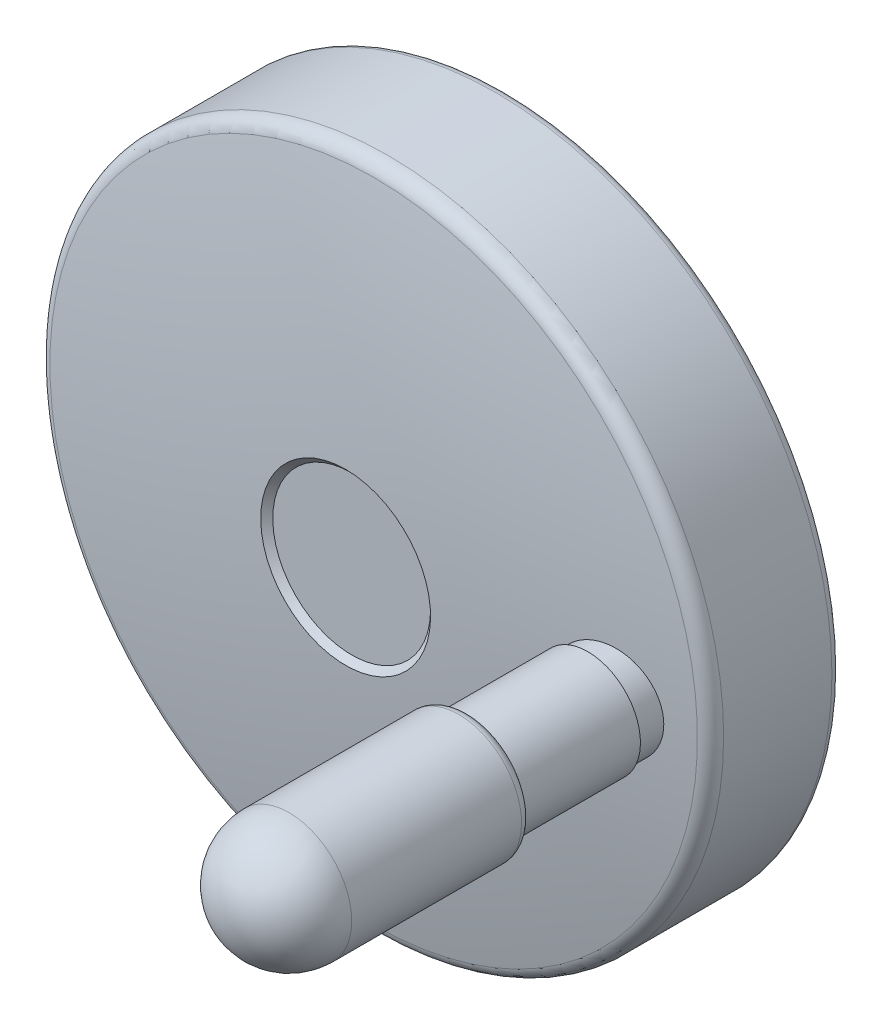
ISO-10303-21;
HEADER;
FILE_DESCRIPTION(('STEP AP214'),'2;1');
FILE_NAME('part.step','',(''),(''),'','','');
FILE_SCHEMA(('AUTOMOTIVE_DESIGN { 1 0 10303 214 1 1 1 1 }'));
ENDSEC;
DATA;
#1=APPLICATION_CONTEXT('core data for automotive mechanical design processes');
#2=APPLICATION_PROTOCOL_DEFINITION('international standard','automotive_design',2000,#1);
#3=PRODUCT_CONTEXT('',#1,'mechanical');
#4=PRODUCT('Part','Part','',(#3));
#5=PRODUCT_RELATED_PRODUCT_CATEGORY('part','',(#4));
#6=PRODUCT_DEFINITION_FORMATION('','',#4);
#7=PRODUCT_DEFINITION_CONTEXT('part definition',#1,'design');
#8=PRODUCT_DEFINITION('design','',#6,#7);
#9=PRODUCT_DEFINITION_SHAPE('','',#8);
#10=(LENGTH_UNIT() NAMED_UNIT(*) SI_UNIT(.MILLI.,.METRE.));
#11=(NAMED_UNIT(*) PLANE_ANGLE_UNIT() SI_UNIT($,.RADIAN.));
#12=(NAMED_UNIT(*) SI_UNIT($,.STERADIAN.) SOLID_ANGLE_UNIT());
#13=UNCERTAINTY_MEASURE_WITH_UNIT(LENGTH_MEASURE(1.E-05),#10,'distance_accuracy_value','');
#14=(GEOMETRIC_REPRESENTATION_CONTEXT(3) GLOBAL_UNCERTAINTY_ASSIGNED_CONTEXT((#13)) GLOBAL_UNIT_ASSIGNED_CONTEXT((#10,
#11,#12)) REPRESENTATION_CONTEXT('',''));
#15=CARTESIAN_POINT('',(0.,0.,0.));
#16=DIRECTION('',(0.,0.,1.));
#17=DIRECTION('',(1.,0.,0.));
#18=AXIS2_PLACEMENT_3D('',#15,#16,#17);
#19=CARTESIAN_POINT('',(0.,0.,29.));
#20=DIRECTION('',(0.,0.,1.));
#21=DIRECTION('',(0.,1.,0.));
#22=AXIS2_PLACEMENT_3D('',#19,#20,#21);
#23=PLANE('',#22);
#24=CARTESIAN_POINT('',(30.5,0.,29.));
#25=DIRECTION('',(0.,0.,1.));
#26=DIRECTION('',(0.,1.,0.));
#27=AXIS2_PLACEMENT_3D('',#24,#25,#26);
#28=CIRCLE('',#27,4.875);
#29=CARTESIAN_POINT('',(30.5,4.87499999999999,29.));
#30=VERTEX_POINT('',#29);
#31=EDGE_CURVE('E277',#30,#30,#28,.T.);
#32=ORIENTED_EDGE('',*,*,#31,.F.);
#33=EDGE_LOOP('',(#32));
#34=FACE_BOUND('',#33,.T.);
#35=CARTESIAN_POINT('',(30.5,0.,29.));
#36=DIRECTION('',(0.,0.,-1.));
#37=DIRECTION('',(0.,-1.,0.));
#38=AXIS2_PLACEMENT_3D('',#35,#36,#37);
#39=CIRCLE('',#38,6.);
#40=CARTESIAN_POINT('',(30.5,-6.,29.));
#41=VERTEX_POINT('',#40);
#42=EDGE_CURVE('E561',#41,#41,#39,.T.);
#43=ORIENTED_EDGE('',*,*,#42,.F.);
#44=EDGE_LOOP('',(#43));
#45=FACE_BOUND('',#44,.T.);
#46=ADVANCED_FACE('F15',(#34,#45),#23,.T.);
#47=CARTESIAN_POINT('',(30.5,0.,25.));
#48=DIRECTION('',(0.,0.,-1.));
#49=DIRECTION('',(0.,-1.,0.));
#50=AXIS2_PLACEMENT_3D('',#47,#48,#49);
#51=CYLINDRICAL_SURFACE('',#50,6.);
#52=CARTESIAN_POINT('',(24.5,0.,27.6143071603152));
#53=CARTESIAN_POINT('',(24.5000009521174,0.167229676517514,27.6143070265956));
#54=CARTESIAN_POINT('',(24.5069975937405,0.334490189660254,27.6133186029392));
#55=CARTESIAN_POINT('',(24.5349379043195,0.66785375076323,27.6093713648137));
#56=CARTESIAN_POINT('',(24.5558858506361,0.833956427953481,27.606411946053));
#57=CARTESIAN_POINT('',(24.6116186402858,1.16405510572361,27.5985380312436));
#58=CARTESIAN_POINT('',(24.6464255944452,1.3280473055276,27.5936204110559));
#59=CARTESIAN_POINT('',(24.7296467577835,1.65260800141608,27.5818621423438));
#60=CARTESIAN_POINT('',(24.7780716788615,1.81317369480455,27.5750199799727));
#61=CARTESIAN_POINT('',(24.8880461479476,2.12930204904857,27.5594802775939));
#62=CARTESIAN_POINT('',(24.9495700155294,2.28487382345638,27.5507863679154));
#63=CARTESIAN_POINT('',(25.0853707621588,2.59031604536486,27.5315950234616));
#64=CARTESIAN_POINT('',(25.1596533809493,2.74018388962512,27.5210967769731));
#65=CARTESIAN_POINT('',(25.3204096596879,3.0331103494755,27.4983754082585));
#66=CARTESIAN_POINT('',(25.4068843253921,3.17616840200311,27.4861521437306));
#67=CARTESIAN_POINT('',(25.591344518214,3.45441028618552,27.4600760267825));
#68=CARTESIAN_POINT('',(25.6893249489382,3.58959756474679,27.4462238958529));
#69=CARTESIAN_POINT('',(25.8966280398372,3.85188881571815,27.4169129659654));
#70=CARTESIAN_POINT('',(26.0060044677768,3.97894944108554,27.4014465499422));
#71=CARTESIAN_POINT('',(26.2347880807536,4.22326275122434,27.3690915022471));
#72=CARTESIAN_POINT('',(26.3541854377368,4.34052482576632,27.3522042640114));
#73=CARTESIAN_POINT('',(26.6023049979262,4.56463962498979,27.3171064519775));
#74=CARTESIAN_POINT('',(26.7310317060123,4.67148726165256,27.2988952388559));
#75=CARTESIAN_POINT('',(26.9968731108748,4.87401595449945,27.2612810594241));
#76=CARTESIAN_POINT('',(27.1339898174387,4.96969431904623,27.2418778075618));
#77=CARTESIAN_POINT('',(27.4168805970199,5.15002553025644,27.2018404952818));
#78=CARTESIAN_POINT('',(27.5627213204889,5.2345717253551,27.1811969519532));
#79=CARTESIAN_POINT('',(27.8609443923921,5.39108100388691,27.1389775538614));
#80=CARTESIAN_POINT('',(28.0133291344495,5.46303943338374,27.1174013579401));
#81=CARTESIAN_POINT('',(28.3234609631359,5.59383505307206,27.0734828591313));
#82=CARTESIAN_POINT('',(28.4812062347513,5.65267663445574,27.051140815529));
#83=CARTESIAN_POINT('',(28.8010597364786,5.75690064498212,27.0058315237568));
#84=CARTESIAN_POINT('',(28.9631695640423,5.80227807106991,26.9828640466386));
#85=CARTESIAN_POINT('',(29.291955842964,5.8795739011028,26.9362744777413));
#86=CARTESIAN_POINT('',(29.4586593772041,5.91137478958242,26.9126484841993));
#87=CARTESIAN_POINT('',(29.7941802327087,5.96075351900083,26.865088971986));
#88=CARTESIAN_POINT('',(29.9629983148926,5.97832608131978,26.8411553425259));
#89=CARTESIAN_POINT('',(30.3014406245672,5.99910895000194,26.7931657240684));
#90=CARTESIAN_POINT('',(30.4710645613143,6.002324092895,26.7691097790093));
#91=CARTESIAN_POINT('',(30.8100436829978,5.9943828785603,26.7210279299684));
#92=CARTESIAN_POINT('',(30.9793987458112,5.98322122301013,26.6970020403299));
#93=CARTESIAN_POINT('',(31.3172944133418,5.94651420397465,26.6490578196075));
#94=CARTESIAN_POINT('',(31.4858285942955,5.92090852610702,26.6251403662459));
#95=CARTESIAN_POINT('',(31.8202181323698,5.8554299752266,26.5776778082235));
#96=CARTESIAN_POINT('',(31.9860725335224,5.8155521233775,26.5541328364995));
#97=CARTESIAN_POINT('',(32.3138307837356,5.72180624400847,26.5075962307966));
#98=CARTESIAN_POINT('',(32.4757352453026,5.66794040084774,26.4846045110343));
#99=CARTESIAN_POINT('',(32.7944560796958,5.54657992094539,26.4393365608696));
#100=CARTESIAN_POINT('',(32.9512724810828,5.47908536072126,26.4170603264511));
#101=CARTESIAN_POINT('',(33.2584436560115,5.33104219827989,26.3734192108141));
#102=CARTESIAN_POINT('',(33.4088081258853,5.25051411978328,26.3520529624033));
#103=CARTESIAN_POINT('',(33.7021894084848,5.07691097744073,26.3103586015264));
#104=CARTESIAN_POINT('',(33.8452088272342,4.98384040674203,26.2900301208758));
#105=CARTESIAN_POINT('',(34.1229453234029,4.7857464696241,26.2505479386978));
#106=CARTESIAN_POINT('',(34.2576602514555,4.680720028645,26.2313945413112));
#107=CARTESIAN_POINT('',(34.5177008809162,4.45950749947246,26.1944180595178));
#108=CARTESIAN_POINT('',(34.6430301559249,4.34332569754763,26.176594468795));
#109=CARTESIAN_POINT('',(34.8825480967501,4.10146660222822,26.1425277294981));
#110=CARTESIAN_POINT('',(34.9968109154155,3.97586422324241,26.1262740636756));
#111=CARTESIAN_POINT('',(35.2143248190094,3.71536314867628,26.0953299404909));
#112=CARTESIAN_POINT('',(35.3175801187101,3.58046804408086,26.0806388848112));
#113=CARTESIAN_POINT('',(35.5124335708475,3.3021790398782,26.0529128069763));
#114=CARTESIAN_POINT('',(35.6040221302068,3.15877828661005,26.0398791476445));
#115=CARTESIAN_POINT('',(35.7747155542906,2.86465960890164,26.0155864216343));
#116=CARTESIAN_POINT('',(35.8538252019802,2.71394451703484,26.004326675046));
#117=CARTESIAN_POINT('',(35.998374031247,2.40755662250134,25.9837515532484));
#118=CARTESIAN_POINT('',(36.0639247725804,2.25193750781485,25.9744203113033));
#119=CARTESIAN_POINT('',(36.18168352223,1.93569835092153,25.957656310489));
#120=CARTESIAN_POINT('',(36.2338967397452,1.77508028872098,25.9502228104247));
#121=CARTESIAN_POINT('',(36.3245353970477,1.45023312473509,25.9373182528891));
#122=CARTESIAN_POINT('',(36.3629849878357,1.28601089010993,25.9318437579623));
#123=CARTESIAN_POINT('',(36.4259166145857,0.954926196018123,25.9228832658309));
#124=CARTESIAN_POINT('',(36.4504056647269,0.788065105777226,25.9193962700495));
#125=CARTESIAN_POINT('',(36.4785444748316,0.517442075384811,25.9153895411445));
#126=CARTESIAN_POINT('',(36.4865876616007,0.414126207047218,25.9142442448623));
#127=CARTESIAN_POINT('',(36.4973157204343,0.207210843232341,25.9127166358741));
#128=CARTESIAN_POINT('',(36.5000005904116,0.103611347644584,25.9123343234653));
#129=CARTESIAN_POINT('',(36.4999990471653,-0.167212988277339,25.9123345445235));
#130=CARTESIAN_POINT('',(36.4930037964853,-0.334456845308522,25.9133306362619));
#131=CARTESIAN_POINT('',(36.4650690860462,-0.667787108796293,25.9173083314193));
#132=CARTESIAN_POINT('',(36.4441253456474,-0.833873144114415,25.9202905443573));
#133=CARTESIAN_POINT('',(36.3884038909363,-1.16393864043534,25.9282245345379));
#134=CARTESIAN_POINT('',(36.3536040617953,-1.32791429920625,25.933179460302));
#135=CARTESIAN_POINT('',(36.2704002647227,-1.65244196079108,25.9450257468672));
#136=CARTESIAN_POINT('',(36.221985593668,-1.81299116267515,25.9519186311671));
#137=CARTESIAN_POINT('',(36.1120351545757,-2.12908618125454,25.9675715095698));
#138=CARTESIAN_POINT('',(36.0505251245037,-2.28464113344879,25.9763278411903));
#139=CARTESIAN_POINT('',(35.9147556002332,-2.59005051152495,25.9956540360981));
#140=CARTESIAN_POINT('',(35.8404903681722,-2.73990233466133,26.0062247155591));
#141=CARTESIAN_POINT('',(35.6797723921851,-3.03279819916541,26.0290988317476));
#142=CARTESIAN_POINT('',(35.5933186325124,-3.17584167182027,26.0414024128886));
#143=CARTESIAN_POINT('',(35.4089037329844,-3.45405634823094,26.0676446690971));
#144=CARTESIAN_POINT('',(35.3109476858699,-3.58923099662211,26.0815826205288));
#145=CARTESIAN_POINT('',(35.1036876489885,-3.85151105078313,26.111069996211));
#146=CARTESIAN_POINT('',(34.9943289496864,-3.97857235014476,26.1266271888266));
#147=CARTESIAN_POINT('',(34.7655819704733,-4.22288853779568,26.159164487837));
#148=CARTESIAN_POINT('',(34.6462035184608,-4.34015281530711,26.1761431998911));
#149=CARTESIAN_POINT('',(34.398122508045,-4.56427410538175,26.211422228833));
#150=CARTESIAN_POINT('',(34.2694154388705,-4.67112602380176,26.2297231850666));
#151=CARTESIAN_POINT('',(34.0036135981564,-4.87366567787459,26.2675125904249));
#152=CARTESIAN_POINT('',(33.8665168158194,-4.96935072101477,26.2870013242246));
#153=CARTESIAN_POINT('',(33.5836468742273,-5.14971003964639,26.3272063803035));
#154=CARTESIAN_POINT('',(33.4378060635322,-5.23427609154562,26.3479322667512));
#155=CARTESIAN_POINT('',(33.1395801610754,-5.39082451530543,26.3903076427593));
#156=CARTESIAN_POINT('',(32.9871926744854,-5.46280223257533,26.4119574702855));
#157=CARTESIAN_POINT('',(32.6770523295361,-5.59363564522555,26.4560124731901));
#158=CARTESIAN_POINT('',(32.5193012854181,-5.65249572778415,26.4784173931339));
#159=CARTESIAN_POINT('',(32.1994329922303,-5.75675557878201,26.5238400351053));
#160=CARTESIAN_POINT('',(32.037314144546,-5.80215034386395,26.546857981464));
#161=CARTESIAN_POINT('',(31.7085023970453,-5.87948025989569,26.5935356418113));
#162=CARTESIAN_POINT('',(31.5417823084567,-5.91129754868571,26.6171991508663));
#163=CARTESIAN_POINT('',(31.2062247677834,-5.96070612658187,26.6648187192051));
#164=CARTESIAN_POINT('',(31.0373865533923,-5.97829213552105,26.6887748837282));
#165=CARTESIAN_POINT('',(30.6989007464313,-5.99909827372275,26.7367939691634));
#166=CARTESIAN_POINT('',(30.5292534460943,-6.00232324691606,26.7608568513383));
#167=CARTESIAN_POINT('',(30.1902247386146,-5.99439745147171,26.8089368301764));
#168=CARTESIAN_POINT('',(30.0208434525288,-5.98324138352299,26.832953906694));
#169=CARTESIAN_POINT('',(29.6829113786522,-5.94654272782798,26.8808623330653));
#170=CARTESIAN_POINT('',(29.5143668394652,-5.92094136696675,26.9047527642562));
#171=CARTESIAN_POINT('',(29.1799545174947,-5.85546920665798,26.9521464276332));
#172=CARTESIAN_POINT('',(29.0140876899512,-5.81559342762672,26.9756495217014));
#173=CARTESIAN_POINT('',(28.6863032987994,-5.72184911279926,27.0220886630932));
#174=CARTESIAN_POINT('',(28.5243851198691,-5.66798277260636,27.0450247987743));
#175=CARTESIAN_POINT('',(28.2056361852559,-5.54661851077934,27.0901694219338));
#176=CARTESIAN_POINT('',(28.0488054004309,-5.47912066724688,27.1123779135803));
#177=CARTESIAN_POINT('',(27.7416272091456,-5.33107857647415,27.1558703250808));
#178=CARTESIAN_POINT('',(27.5912692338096,-5.25055670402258,27.1771557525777));
#179=CARTESIAN_POINT('',(27.2978996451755,-5.07696686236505,27.2186807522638));
#180=CARTESIAN_POINT('',(27.1548854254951,-4.98390338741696,27.2389206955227));
#181=CARTESIAN_POINT('',(26.877158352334,-4.78582465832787,27.2782205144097));
#182=CARTESIAN_POINT('',(26.7424476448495,-4.68080633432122,27.297280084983));
#183=CARTESIAN_POINT('',(26.4824145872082,-4.45961119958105,27.3340663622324));
#184=CARTESIAN_POINT('',(26.3570886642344,-4.343438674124,27.3517935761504));
#185=CARTESIAN_POINT('',(26.1175812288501,-4.10160413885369,27.3856677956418));
#186=CARTESIAN_POINT('',(26.0033251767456,-3.97601742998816,27.4018253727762));
#187=CARTESIAN_POINT('',(25.7858230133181,-3.71554996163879,27.4325804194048));
#188=CARTESIAN_POINT('',(25.6825726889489,-3.58067279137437,27.4471784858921));
#189=CARTESIAN_POINT('',(25.4877270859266,-3.30242197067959,27.4747242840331));
#190=CARTESIAN_POINT('',(25.3961414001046,-3.1590414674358,27.4876706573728));
#191=CARTESIAN_POINT('',(25.2254511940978,-2.86496548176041,27.5117972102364));
#192=CARTESIAN_POINT('',(25.1463418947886,-2.71427282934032,27.5229780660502));
#193=CARTESIAN_POINT('',(25.001783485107,-2.40791608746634,27.5434077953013));
#194=CARTESIAN_POINT('',(24.9362241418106,-2.25230504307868,27.5526722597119));
#195=CARTESIAN_POINT('',(24.8184475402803,-1.93608259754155,27.569314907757));
#196=CARTESIAN_POINT('',(24.7662250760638,-1.77547317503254,27.576693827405));
#197=CARTESIAN_POINT('',(24.675566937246,-1.45064340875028,27.5895031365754));
#198=CARTESIAN_POINT('',(24.6371071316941,-1.28642992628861,27.5949369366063));
#199=CARTESIAN_POINT('',(24.5741539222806,-0.955362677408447,27.6038310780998));
#200=CARTESIAN_POINT('',(24.5496535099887,-0.788510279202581,27.6072924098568));
#201=CARTESIAN_POINT('',(24.5214869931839,-0.517820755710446,27.6112716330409));
#202=CARTESIAN_POINT('',(24.5134320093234,-0.414429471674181,27.6124095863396));
#203=CARTESIAN_POINT('',(24.5026882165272,-0.207362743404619,27.6139273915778));
#204=CARTESIAN_POINT('',(24.4999994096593,-0.103687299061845,27.6143072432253));
#205=CARTESIAN_POINT('',(24.5,0.,27.6143071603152));
#206=B_SPLINE_CURVE_WITH_KNOTS('',3,(#52,#53,#54,#55,#56,#57,#58,#59,#60,#61,#62,#63,#64,#65,
#66,#67,#68,#69,#70,#71,#72,#73,#74,#75,#76,#77,#78,#79,#80,#81,#82,#83,#84,#85,#86,#87,#88,#89,
#90,#91,#92,#93,#94,#95,#96,#97,#98,#99,#100,#101,#102,#103,#104,#105,#106,#107,#108,#109,#110,
#111,#112,#113,#114,#115,#116,#117,#118,#119,#120,#121,#122,#123,#124,#125,#126,#127,#128,#129,
#130,#131,#132,#133,#134,#135,#136,#137,#138,#139,#140,#141,#142,#143,#144,#145,#146,#147,#148,
#149,#150,#151,#152,#153,#154,#155,#156,#157,#158,#159,#160,#161,#162,#163,#164,#165,#166,#167,
#168,#169,#170,#171,#172,#173,#174,#175,#176,#177,#178,#179,#180,#181,#182,#183,#184,#185,#186,
#187,#188,#189,#190,#191,#192,#193,#194,#195,#196,#197,#198,#199,#200,#201,#202,#203,#204,#205),
.UNSPECIFIED.,.T.,.F.,(4,2,2,2,2,2,2,2,2,2,2,2,2,2,2,2,2,2,2,2,2,2,2,2,2,2,2,2,2,2,2,2,2,2,2,2,
2,2,2,2,2,2,2,2,2,2,2,2,2,2,2,2,2,2,2,2,2,2,2,2,2,2,2,2,2,2,2,2,2,2,2,2,2,2,2,2,4),(0.,
0.501593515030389,1.00334088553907,1.50589197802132,2.00883948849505,2.51080990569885,
3.0130067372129,3.51524502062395,4.01726167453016,4.52176449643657,5.02577818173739,
5.5300368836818,6.03441685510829,6.54332326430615,7.05241743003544,7.56134090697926,
8.07045325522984,8.58388716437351,9.09751146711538,9.61096273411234,10.1246032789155,
10.6404046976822,11.1563862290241,11.6722872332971,12.18818534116,12.7032788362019,
13.21818829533,13.733230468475,14.2480755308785,14.7591895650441,15.2701071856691,
15.7814422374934,16.2925808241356,16.7993300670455,17.3058810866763,17.8115388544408,
18.3169423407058,18.6277171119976,18.938492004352,19.4400355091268,19.94173300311,
20.4442344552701,20.9471320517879,21.4490502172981,21.9511947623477,22.4533811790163,
22.9553460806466,23.4598410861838,23.9638469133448,24.4680980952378,24.9724706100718,
25.4814369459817,25.9905910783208,26.4995746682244,27.0087471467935,27.5222538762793,
28.0359510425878,28.5494749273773,29.063188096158,29.5790066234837,30.0950052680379,
30.6109229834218,31.1268377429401,31.6418754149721,32.1567290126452,32.6717151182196,
33.1865041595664,33.6975427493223,34.2083850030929,34.7196446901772,35.2307080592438,
35.7374341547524,36.2439621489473,36.7495976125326,37.2549789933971,37.5659815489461,
37.8769842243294),.UNSPECIFIED.);
#207=CARTESIAN_POINT('',(24.5,0.,27.6143071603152));
#208=VERTEX_POINT('',#207);
#209=EDGE_CURVE('E573',#208,#208,#206,.T.);
#210=ORIENTED_EDGE('',*,*,#209,.F.);
#211=EDGE_LOOP('',(#210));
#212=FACE_BOUND('',#211,.T.);
#213=ORIENTED_EDGE('',*,*,#42,.T.);
#214=EDGE_LOOP('',(#213));
#215=FACE_BOUND('',#214,.T.);
#216=ADVANCED_FACE('F583',(#212,#215),#51,.T.);
#217=CARTESIAN_POINT('',(0.,0.,-188.281250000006));
#218=DIRECTION('',(-1.,0.,0.));
#219=DIRECTION('',(0.,0.,1.));
#220=AXIS2_PLACEMENT_3D('',#217,#218,#219);
#221=SPHERICAL_SURFACE('',#220,217.281250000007);
#222=CARTESIAN_POINT('',(0.,0.,25.2804746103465));
#223=DIRECTION('',(0.,0.,1.));
#224=DIRECTION('',(0.,1.,0.));
#225=AXIS2_PLACEMENT_3D('',#222,#223,#224);
#226=CIRCLE('',#225,40.0316297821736);
#227=CARTESIAN_POINT('',(0.,40.0316297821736,25.2804746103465));
#228=VERTEX_POINT('',#227);
#229=EDGE_CURVE('E271',#228,#228,#226,.T.);
#230=ORIENTED_EDGE('',*,*,#229,.T.);
#231=EDGE_LOOP('',(#230));
#232=FACE_BOUND('',#231,.T.);
#233=CARTESIAN_POINT('',(0.,0.,28.7461482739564));
#234=DIRECTION('',(0.,0.,1.));
#235=DIRECTION('',(0.,1.,0.));
#236=AXIS2_PLACEMENT_3D('',#233,#234,#235);
#237=CIRCLE('',#236,10.5);
#238=CARTESIAN_POINT('',(0.,10.5,28.7461482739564));
#239=VERTEX_POINT('',#238);
#240=EDGE_CURVE('E581',#239,#239,#237,.F.);
#241=ORIENTED_EDGE('',*,*,#240,.T.);
#242=EDGE_LOOP('',(#241));
#243=FACE_BOUND('',#242,.T.);
#244=ORIENTED_EDGE('',*,*,#209,.T.);
#245=EDGE_LOOP('',(#244));
#246=FACE_BOUND('',#245,.T.);
#247=ADVANCED_FACE('F587',(#232,#243,#246),#221,.T.);
#248=CARTESIAN_POINT('',(0.,0.,23.5112878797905));
#249=DIRECTION('',(0.,0.,1.));
#250=DIRECTION('',(0.,1.,0.));
#251=AXIS2_PLACEMENT_3D('',#248,#249,#250);
#252=TOROIDAL_SURFACE('',#251,39.7,1.8);
#253=CARTESIAN_POINT('',(0.,0.,23.5112878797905));
#254=DIRECTION('',(0.,0.,1.));
#255=DIRECTION('',(0.,1.,0.));
#256=AXIS2_PLACEMENT_3D('',#253,#254,#255);
#257=CIRCLE('',#256,41.5);
#258=CARTESIAN_POINT('',(0.,41.5,23.5112878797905));
#259=VERTEX_POINT('',#258);
#260=EDGE_CURVE('E570',#259,#259,#257,.T.);
#261=ORIENTED_EDGE('',*,*,#260,.T.);
#262=EDGE_LOOP('',(#261));
#263=FACE_BOUND('',#262,.T.);
#264=ORIENTED_EDGE('',*,*,#229,.F.);
#265=EDGE_LOOP('',(#264));
#266=FACE_BOUND('',#265,.T.);
#267=ADVANCED_FACE('F592',(#263,#266),#252,.T.);
#268=CARTESIAN_POINT('',(0.,0.,28.7461482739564));
#269=DIRECTION('',(0.,0.,1.));
#270=DIRECTION('',(0.,1.,0.));
#271=AXIS2_PLACEMENT_3D('',#268,#269,#270);
#272=CONICAL_SURFACE('',#271,10.5,0.785398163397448);
#273=CARTESIAN_POINT('',(0.,0.,28.));
#274=DIRECTION('',(0.,0.,1.));
#275=DIRECTION('',(0.,1.,0.));
#276=AXIS2_PLACEMENT_3D('',#273,#274,#275);
#277=CIRCLE('',#276,9.75385172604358);
#278=CARTESIAN_POINT('',(0.,9.75385172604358,28.));
#279=VERTEX_POINT('',#278);
#280=EDGE_CURVE('E565',#279,#279,#277,.T.);
#281=ORIENTED_EDGE('',*,*,#280,.F.);
#282=EDGE_LOOP('',(#281));
#283=FACE_BOUND('',#282,.T.);
#284=ORIENTED_EDGE('',*,*,#240,.F.);
#285=EDGE_LOOP('',(#284));
#286=FACE_BOUND('',#285,.T.);
#287=ADVANCED_FACE('F605',(#283,#286),#272,.F.);
#288=CARTESIAN_POINT('',(0.,0.,16.8181439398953));
#289=DIRECTION('',(0.,0.,-1.));
#290=DIRECTION('',(0.,-1.,0.));
#291=AXIS2_PLACEMENT_3D('',#288,#289,#290);
#292=CYLINDRICAL_SURFACE('',#291,41.5);
#293=CARTESIAN_POINT('',(0.,0.,10.125));
#294=DIRECTION('',(0.,0.,-1.));
#295=DIRECTION('',(0.,-1.,0.));
#296=AXIS2_PLACEMENT_3D('',#293,#294,#295);
#297=CIRCLE('',#296,41.5);
#298=CARTESIAN_POINT('',(0.,-41.5,10.125));
#299=VERTEX_POINT('',#298);
#300=EDGE_CURVE('E524',#299,#299,#297,.F.);
#301=ORIENTED_EDGE('',*,*,#300,.T.);
#302=EDGE_LOOP('',(#301));
#303=FACE_BOUND('',#302,.T.);
#304=ORIENTED_EDGE('',*,*,#260,.F.);
#305=EDGE_LOOP('',(#304));
#306=FACE_BOUND('',#305,.T.);
#307=ADVANCED_FACE('F603',(#303,#306),#292,.T.);
#308=CARTESIAN_POINT('',(-4.87692586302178,0.,28.));
#309=DIRECTION('',(0.,0.,1.));
#310=DIRECTION('',(0.,1.,0.));
#311=AXIS2_PLACEMENT_3D('',#308,#309,#310);
#312=PLANE('',#311);
#313=ORIENTED_EDGE('',*,*,#280,.T.);
#314=EDGE_LOOP('',(#313));
#315=FACE_BOUND('',#314,.T.);
#316=ADVANCED_FACE('F515',(#315),#312,.T.);
#317=CARTESIAN_POINT('',(0.,0.,10.125));
#318=DIRECTION('',(0.,0.,1.));
#319=DIRECTION('',(0.,1.,0.));
#320=AXIS2_PLACEMENT_3D('',#317,#318,#319);
#321=TOROIDAL_SURFACE('',#320,40.375,1.125);
#322=ORIENTED_EDGE('',*,*,#300,.F.);
#323=EDGE_LOOP('',(#322));
#324=FACE_BOUND('',#323,.T.);
#325=CARTESIAN_POINT('',(0.,0.,9.));
#326=DIRECTION('',(0.,0.,1.));
#327=DIRECTION('',(0.,-1.,0.));
#328=AXIS2_PLACEMENT_3D('',#325,#326,#327);
#329=CIRCLE('',#328,40.375);
#330=CARTESIAN_POINT('',(0.,-40.375,8.9999999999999));
#331=VERTEX_POINT('',#330);
#332=CARTESIAN_POINT('',(0.,40.375,8.9999999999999));
#333=VERTEX_POINT('',#332);
#334=EDGE_CURVE('E552',#331,#333,#329,.T.);
#335=ORIENTED_EDGE('',*,*,#334,.T.);
#336=CARTESIAN_POINT('',(0.,0.,9.));
#337=DIRECTION('',(0.,0.,1.));
#338=DIRECTION('',(0.,1.,0.));
#339=AXIS2_PLACEMENT_3D('',#336,#337,#338);
#340=CIRCLE('',#339,40.375);
#341=CARTESIAN_POINT('',(-40.375,0.,9.));
#342=VERTEX_POINT('',#341);
#343=EDGE_CURVE('E394',#333,#342,#340,.T.);
#344=ORIENTED_EDGE('',*,*,#343,.T.);
#345=CARTESIAN_POINT('',(0.,0.,9.));
#346=DIRECTION('',(0.,0.,1.));
#347=DIRECTION('',(-1.,0.,0.));
#348=AXIS2_PLACEMENT_3D('',#345,#346,#347);
#349=CIRCLE('',#348,40.375);
#350=EDGE_CURVE('E398',#342,#331,#349,.T.);
#351=ORIENTED_EDGE('',*,*,#350,.T.);
#352=EDGE_LOOP('',(#335,#344,#351));
#353=FACE_BOUND('',#352,.T.);
#354=ADVANCED_FACE('F504',(#324,#353),#321,.T.);
#355=CARTESIAN_POINT('',(-40.1075,0.,9.));
#356=DIRECTION('',(0.,0.,-1.));
#357=DIRECTION('',(-1.,0.,0.));
#358=AXIS2_PLACEMENT_3D('',#355,#356,#357);
#359=PLANE('',#358);
#360=CARTESIAN_POINT('',(0.,0.,9.));
#361=DIRECTION('',(0.,0.,-1.));
#362=DIRECTION('',(0.,-1.,0.));
#363=AXIS2_PLACEMENT_3D('',#360,#361,#362);
#364=CIRCLE('',#363,39.84);
#365=CARTESIAN_POINT('',(0.,-39.84,9.));
#366=VERTEX_POINT('',#365);
#367=EDGE_CURVE('E395',#366,#366,#364,.F.);
#368=ORIENTED_EDGE('',*,*,#367,.T.);
#369=EDGE_LOOP('',(#368));
#370=FACE_BOUND('',#369,.T.);
#371=ORIENTED_EDGE('',*,*,#343,.F.);
#372=ORIENTED_EDGE('',*,*,#334,.F.);
#373=ORIENTED_EDGE('',*,*,#350,.F.);
#374=EDGE_LOOP('',(#371,#372,#373));
#375=FACE_BOUND('',#374,.T.);
#376=ADVANCED_FACE('F437',(#370,#375),#359,.T.);
#377=CARTESIAN_POINT('',(0.,0.,16.2811848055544));
#378=DIRECTION('',(0.,0.,-1.));
#379=DIRECTION('',(0.,-1.,0.));
#380=AXIS2_PLACEMENT_3D('',#377,#378,#379);
#381=CYLINDRICAL_SURFACE('',#380,28.22);
#382=CARTESIAN_POINT('',(27.819430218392,-4.7379006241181,19.0571345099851));
#383=CARTESIAN_POINT('',(27.8371846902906,-4.63364547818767,18.957664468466));
#384=CARTESIAN_POINT('',(27.8544001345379,-4.52902740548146,18.8584762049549));
#385=CARTESIAN_POINT('',(27.8877496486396,-4.31892928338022,18.6608183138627));
#386=CARTESIAN_POINT('',(27.9038836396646,-4.21344917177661,18.5623487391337));
#387=CARTESIAN_POINT('',(27.9351126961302,-4.0011773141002,18.3659938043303));
#388=CARTESIAN_POINT('',(27.9502043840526,-3.89438251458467,18.2681112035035));
#389=CARTESIAN_POINT('',(27.9792868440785,-3.67962639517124,18.0734743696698));
#390=CARTESIAN_POINT('',(27.9932776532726,-3.57166511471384,17.9767200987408));
#391=CARTESIAN_POINT('',(28.021263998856,-3.34532891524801,17.776684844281));
#392=CARTESIAN_POINT('',(28.0351638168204,-3.22683252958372,17.6735275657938));
#393=CARTESIAN_POINT('',(28.0616466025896,-2.98778417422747,17.4694517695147));
#394=CARTESIAN_POINT('',(28.0742296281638,-2.86723229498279,17.368533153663));
#395=CARTESIAN_POINT('',(28.0980393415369,-2.62365095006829,17.1698816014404));
#396=CARTESIAN_POINT('',(28.1092677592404,-2.50062488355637,17.0721447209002));
#397=CARTESIAN_POINT('',(28.1303452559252,-2.25116719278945,16.8809843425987));
#398=CARTESIAN_POINT('',(28.1401946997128,-2.12473647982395,16.7875597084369));
#399=CARTESIAN_POINT('',(28.1559846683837,-1.90204985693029,16.6313949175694));
#400=CARTESIAN_POINT('',(28.1622627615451,-1.80685855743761,16.567178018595));
#401=CARTESIAN_POINT('',(28.1740071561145,-1.61341801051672,16.4433045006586));
#402=CARTESIAN_POINT('',(28.1794731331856,-1.51516756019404,16.3836497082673));
#403=CARTESIAN_POINT('',(28.1894189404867,-1.31707723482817,16.2718646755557));
#404=CARTESIAN_POINT('',(28.1939168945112,-1.2173127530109,16.2196038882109));
#405=CARTESIAN_POINT('',(28.2019702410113,-1.01372159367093,16.1235831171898));
#406=CARTESIAN_POINT('',(28.2055264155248,-0.909898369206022,16.0798160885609));
#407=CARTESIAN_POINT('',(28.2102855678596,-0.7429106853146,16.0200461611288));
#408=CARTESIAN_POINT('',(28.2118472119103,-0.681155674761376,16.0001363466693));
#409=CARTESIAN_POINT('',(28.2145840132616,-0.556365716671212,15.9649002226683));
#410=CARTESIAN_POINT('',(28.2157594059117,-0.493331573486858,15.9495711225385));
#411=CARTESIAN_POINT('',(28.2177136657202,-0.364991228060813,15.9239206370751));
#412=CARTESIAN_POINT('',(28.2184846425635,-0.299664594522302,15.9136990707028));
#413=CARTESIAN_POINT('',(28.2195760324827,-0.168210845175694,15.8991702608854));
#414=CARTESIAN_POINT('',(28.2198954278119,-0.102082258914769,15.8948763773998));
#415=CARTESIAN_POINT('',(28.219977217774,-0.0358584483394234,15.8938047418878));
#416=B_SPLINE_CURVE_WITH_KNOTS('',3,(#382,#383,#384,#385,#386,#387,#388,#389,#390,#391,#392,
#393,#394,#395,#396,#397,#398,#399,#400,#401,#402,#403,#404,#405,#406,#407,#408,#409,#410,#411,
#412,#413,#414,#415),.UNSPECIFIED.,.F.,.F.,(4,2,2,2,2,2,2,2,2,2,2,2,2,2,2,2,4),(0.,
0.435555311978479,0.871142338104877,1.30808037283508,1.74500367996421,2.21814032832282,
2.69125621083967,3.16376135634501,3.63614126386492,3.9810405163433,4.32607714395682,
4.66394758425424,5.00153657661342,5.19610304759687,5.39055074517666,5.58866297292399,
5.78722098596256),.UNSPECIFIED.);
#417=CARTESIAN_POINT('',(28.2061340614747,-0.884534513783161,16.0720000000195));
#418=VERTEX_POINT('',#417);
#419=CARTESIAN_POINT('',(28.1576786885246,-1.87444148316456,16.6135));
#420=VERTEX_POINT('',#419);
#421=EDGE_CURVE('E26',#418,#420,#416,.F.);
#422=ORIENTED_EDGE('',*,*,#421,.F.);
#423=DIRECTION('',(0.,0.,1.));
#424=VECTOR('',#423,1.);
#425=CARTESIAN_POINT('',(28.2061340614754,-0.884534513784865,21.75));
#426=LINE('',#425,#424);
#427=CARTESIAN_POINT('',(28.2061340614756,-0.884534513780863,15.0415000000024));
#428=VERTEX_POINT('',#427);
#429=EDGE_CURVE('E411',#418,#428,#426,.F.);
#430=ORIENTED_EDGE('',*,*,#429,.T.);
#431=CARTESIAN_POINT('',(28.2061340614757,-0.884534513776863,15.0415000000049));
#432=CARTESIAN_POINT('',(28.2033697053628,-0.972611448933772,15.0071759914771));
#433=CARTESIAN_POINT('',(28.200246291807,-1.05911764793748,14.9691713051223));
#434=CARTESIAN_POINT('',(28.1933520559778,-1.22903996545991,14.8874249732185));
#435=CARTESIAN_POINT('',(28.1895832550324,-1.31246477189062,14.8437013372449));
#436=CARTESIAN_POINT('',(28.1814548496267,-1.47673995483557,14.7519530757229));
#437=CARTESIAN_POINT('',(28.1770957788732,-1.55759257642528,14.7039323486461));
#438=CARTESIAN_POINT('',(28.1678059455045,-1.71741116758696,14.6043552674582));
#439=CARTESIAN_POINT('',(28.1628734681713,-1.79637058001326,14.5527885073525));
#440=CARTESIAN_POINT('',(28.1576786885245,-1.87444148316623,14.5000000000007));
#441=B_SPLINE_CURVE_WITH_KNOTS('',3,(#431,#432,#433,#434,#435,#436,#437,#438,#439,#440),
.UNSPECIFIED.,.F.,.F.,(4,2,2,2,4),(0.,0.283456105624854,0.566040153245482,0.848370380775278,
1.13156772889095),.UNSPECIFIED.);
#442=CARTESIAN_POINT('',(28.1576786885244,-1.87444148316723,14.4999999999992));
#443=VERTEX_POINT('',#442);
#444=EDGE_CURVE('E111',#428,#443,#441,.T.);
#445=ORIENTED_EDGE('',*,*,#444,.T.);
#446=CARTESIAN_POINT('',(0.,0.,14.5));
#447=DIRECTION('',(0.,0.,-1.));
#448=DIRECTION('',(0.,-1.,0.));
#449=AXIS2_PLACEMENT_3D('',#446,#447,#448);
#450=CIRCLE('',#449,28.22);
#451=CARTESIAN_POINT('',(28.0927606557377,-2.67678888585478,14.5));
#452=VERTEX_POINT('',#451);
#453=EDGE_CURVE('E108',#452,#443,#450,.F.);
#454=ORIENTED_EDGE('',*,*,#453,.F.);
#455=DIRECTION('',(0.,0.,-1.));
#456=VECTOR('',#455,1.);
#457=CARTESIAN_POINT('',(28.0927606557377,-2.67678888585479,16.2811848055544));
#458=LINE('',#457,#456);
#459=CARTESIAN_POINT('',(28.0927606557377,-2.67678888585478,12.6));
#460=VERTEX_POINT('',#459);
#461=EDGE_CURVE('E98',#460,#452,#458,.F.);
#462=ORIENTED_EDGE('',*,*,#461,.F.);
#463=CARTESIAN_POINT('',(0.,0.,12.6));
#464=DIRECTION('',(0.,0.,-1.));
#465=DIRECTION('',(0.,-1.,0.));
#466=AXIS2_PLACEMENT_3D('',#463,#464,#465);
#467=CIRCLE('',#466,28.22);
#468=CARTESIAN_POINT('',(28.0927606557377,2.67678888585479,12.6));
#469=VERTEX_POINT('',#468);
#470=EDGE_CURVE('E80',#469,#460,#467,.F.);
#471=ORIENTED_EDGE('',*,*,#470,.F.);
#472=DIRECTION('',(0.,0.,-1.));
#473=VECTOR('',#472,1.);
#474=CARTESIAN_POINT('',(28.0927606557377,2.6767888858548,16.2811848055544));
#475=LINE('',#474,#473);
#476=CARTESIAN_POINT('',(28.0927606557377,2.67678888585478,14.5));
#477=VERTEX_POINT('',#476);
#478=EDGE_CURVE('E91',#477,#469,#475,.T.);
#479=ORIENTED_EDGE('',*,*,#478,.F.);
#480=CARTESIAN_POINT('',(0.,0.,14.5));
#481=DIRECTION('',(0.,0.,-1.));
#482=DIRECTION('',(0.,-1.,0.));
#483=AXIS2_PLACEMENT_3D('',#480,#481,#482);
#484=CIRCLE('',#483,28.22);
#485=CARTESIAN_POINT('',(28.1576786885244,1.87444148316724,14.4999999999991));
#486=VERTEX_POINT('',#485);
#487=EDGE_CURVE('E102',#477,#486,#484,.T.);
#488=ORIENTED_EDGE('',*,*,#487,.T.);
#489=CARTESIAN_POINT('',(28.2061340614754,0.88453451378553,15.0415000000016));
#490=CARTESIAN_POINT('',(28.2033697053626,0.972611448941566,15.0071759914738));
#491=CARTESIAN_POINT('',(28.2002462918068,1.05911764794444,14.9691713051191));
#492=CARTESIAN_POINT('',(28.1933520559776,1.22903996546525,14.8874249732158));
#493=CARTESIAN_POINT('',(28.1895832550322,1.3124647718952,14.8437013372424));
#494=CARTESIAN_POINT('',(28.1814548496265,1.47673995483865,14.7519530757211));
#495=CARTESIAN_POINT('',(28.177095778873,1.55759257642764,14.7039323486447));
#496=CARTESIAN_POINT('',(28.1678059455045,1.71741116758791,14.6043552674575));
#497=CARTESIAN_POINT('',(28.1628734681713,1.79637058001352,14.5527885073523));
#498=CARTESIAN_POINT('',(28.1576786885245,1.87444148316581,14.500000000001));
#499=B_SPLINE_CURVE_WITH_KNOTS('',3,(#489,#490,#491,#492,#493,#494,#495,#496,#497,#498),
.UNSPECIFIED.,.F.,.F.,(4,2,2,2,4),(0.,0.283456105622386,0.566040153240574,0.848370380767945,
1.13156772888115),.UNSPECIFIED.);
#500=CARTESIAN_POINT('',(28.2061340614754,0.884534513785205,15.0415000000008));
#501=VERTEX_POINT('',#500);
#502=EDGE_CURVE('E423',#501,#486,#499,.T.);
#503=ORIENTED_EDGE('',*,*,#502,.F.);
#504=DIRECTION('',(0.,0.,1.));
#505=VECTOR('',#504,1.);
#506=CARTESIAN_POINT('',(28.2061340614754,0.884534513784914,21.75));
#507=LINE('',#506,#505);
#508=CARTESIAN_POINT('',(28.2061340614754,0.884534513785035,16.0720000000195));
#509=VERTEX_POINT('',#508);
#510=EDGE_CURVE('E400',#501,#509,#507,.T.);
#511=ORIENTED_EDGE('',*,*,#510,.T.);
#512=CARTESIAN_POINT('',(28.0367714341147,3.21058367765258,17.6601458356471));
#513=CARTESIAN_POINT('',(28.0459385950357,3.13052012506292,17.5910607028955));
#514=CARTESIAN_POINT('',(28.0548094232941,3.05003051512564,17.5224225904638));
#515=CARTESIAN_POINT('',(28.0719526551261,2.88799766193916,17.3862846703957));
#516=CARTESIAN_POINT('',(28.0802249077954,2.80645415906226,17.318785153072));
#517=CARTESIAN_POINT('',(28.096219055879,2.64154950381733,17.1847137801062));
#518=CARTESIAN_POINT('',(28.1039364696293,2.55817940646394,17.1181523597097));
#519=CARTESIAN_POINT('',(28.1187408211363,2.38996754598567,16.9868539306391));
#520=CARTESIAN_POINT('',(28.1258278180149,2.3051259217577,16.9221167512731));
#521=CARTESIAN_POINT('',(28.1390801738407,2.13714161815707,16.7975584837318));
#522=CARTESIAN_POINT('',(28.1452712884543,2.05407009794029,16.7376445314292));
#523=CARTESIAN_POINT('',(28.1570361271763,1.88595270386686,16.620594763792));
#524=CARTESIAN_POINT('',(28.1626099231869,1.80090706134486,16.5634586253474));
#525=CARTESIAN_POINT('',(28.1730975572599,1.62862099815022,16.452953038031));
#526=CARTESIAN_POINT('',(28.1780128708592,1.54138602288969,16.3995752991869));
#527=CARTESIAN_POINT('',(28.187150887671,1.36411126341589,16.2976734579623));
#528=CARTESIAN_POINT('',(28.1913739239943,1.27407285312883,16.249147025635));
#529=CARTESIAN_POINT('',(28.1984682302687,1.10489857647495,16.1656178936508));
#530=CARTESIAN_POINT('',(28.201447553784,1.02623141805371,16.1296844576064));
#531=CARTESIAN_POINT('',(28.2068078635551,0.866470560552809,16.0638474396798));
#532=CARTESIAN_POINT('',(28.209189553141,0.785379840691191,16.033936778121));
#533=CARTESIAN_POINT('',(28.2133251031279,0.619412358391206,15.9812583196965));
#534=CARTESIAN_POINT('',(28.2150684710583,0.53449605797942,15.9586105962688));
#535=CARTESIAN_POINT('',(28.2171203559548,0.405443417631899,15.9317189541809));
#536=CARTESIAN_POINT('',(28.2177112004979,0.362038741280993,15.923924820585));
#537=CARTESIAN_POINT('',(28.2186955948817,0.274819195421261,15.9108914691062));
#538=CARTESIAN_POINT('',(28.2190890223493,0.2310040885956,15.9056538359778));
#539=CARTESIAN_POINT('',(28.2193800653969,0.187052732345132,15.9017779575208));
#540=B_SPLINE_CURVE_WITH_KNOTS('',3,(#512,#513,#514,#515,#516,#517,#518,#519,#520,#521,#522,
#523,#524,#525,#526,#527,#528,#529,#530,#531,#532,#533,#534,#535,#536,#537,#538,#539),
.UNSPECIFIED.,.F.,.F.,(4,2,2,2,2,2,2,2,2,2,2,2,2,4),(0.,0.318442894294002,0.636965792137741,
0.957824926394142,1.27865393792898,1.58643958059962,1.8941893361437,2.20123751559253,
2.50813751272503,2.76755059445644,3.02665693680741,3.28984912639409,3.4220888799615,
3.55441050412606),.UNSPECIFIED.);
#541=CARTESIAN_POINT('',(28.1576786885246,1.87444148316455,16.6135));
#542=VERTEX_POINT('',#541);
#543=EDGE_CURVE('E426',#542,#509,#540,.T.);
#544=ORIENTED_EDGE('',*,*,#543,.F.);
#545=DIRECTION('',(0.,0.,-1.));
#546=VECTOR('',#545,1.);
#547=CARTESIAN_POINT('',(28.1576786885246,1.87444148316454,16.2811848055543));
#548=LINE('',#547,#546);
#549=CARTESIAN_POINT('',(28.1576786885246,1.87444148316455,19.9623696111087));
#550=VERTEX_POINT('',#549);
#551=EDGE_CURVE('E289',#550,#542,#548,.T.);
#552=ORIENTED_EDGE('',*,*,#551,.F.);
#553=CARTESIAN_POINT('',(0.,0.,19.9623696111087));
#554=DIRECTION('',(0.,0.,-1.));
#555=DIRECTION('',(0.,-1.,0.));
#556=AXIS2_PLACEMENT_3D('',#553,#554,#555);
#557=CIRCLE('',#556,28.22);
#558=CARTESIAN_POINT('',(28.1576786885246,-1.87444148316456,19.9623696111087));
#559=VERTEX_POINT('',#558);
#560=EDGE_CURVE('E420',#559,#550,#557,.T.);
#561=ORIENTED_EDGE('',*,*,#560,.F.);
#562=DIRECTION('',(0.,0.,-1.));
#563=VECTOR('',#562,1.);
#564=CARTESIAN_POINT('',(28.1576786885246,-1.87444148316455,16.2811848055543));
#565=LINE('',#564,#563);
#566=EDGE_CURVE('E301',#420,#559,#565,.F.);
#567=ORIENTED_EDGE('',*,*,#566,.F.);
#568=EDGE_LOOP('',(#422,#430,#445,#454,#462,#471,#479,#488,#503,#511,#544,#552,#561,#567));
#569=FACE_BOUND('',#568,.T.);
#570=ADVANCED_FACE('F105',(#569),#381,.F.);
#571=CARTESIAN_POINT('',(30.5,0.,21.75));
#572=DIRECTION('',(0.,0.,1.));
#573=DIRECTION('',(0.,1.,0.));
#574=AXIS2_PLACEMENT_3D('',#571,#572,#573);
#575=CYLINDRICAL_SURFACE('',#574,2.4585);
#576=CARTESIAN_POINT('',(30.5,0.,16.0720000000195));
#577=DIRECTION('',(0.,0.,1.));
#578=DIRECTION('',(0.,1.,0.));
#579=AXIS2_PLACEMENT_3D('',#576,#577,#578);
#580=CIRCLE('',#579,2.4585);
#581=EDGE_CURVE('E35',#509,#418,#580,.F.);
#582=ORIENTED_EDGE('',*,*,#581,.F.);
#583=ORIENTED_EDGE('',*,*,#510,.F.);
#584=CARTESIAN_POINT('',(30.5,0.,15.0415));
#585=DIRECTION('',(0.,0.,1.));
#586=DIRECTION('',(0.,1.,0.));
#587=AXIS2_PLACEMENT_3D('',#584,#585,#586);
#588=CIRCLE('',#587,2.4585);
#589=EDGE_CURVE('E410',#428,#501,#588,.T.);
#590=ORIENTED_EDGE('',*,*,#589,.F.);
#591=ORIENTED_EDGE('',*,*,#429,.F.);
#592=EDGE_LOOP('',(#582,#583,#590,#591));
#593=FACE_BOUND('',#592,.T.);
#594=ADVANCED_FACE('F385',(#593),#575,.F.);
#595=CARTESIAN_POINT('',(30.5,0.,14.5000000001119));
#596=DIRECTION('',(0.,0.,-1.));
#597=DIRECTION('',(0.,-1.,0.));
#598=AXIS2_PLACEMENT_3D('',#595,#596,#597);
#599=CONICAL_SURFACE('',#598,2.99999999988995,0.785398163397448);
#600=ORIENTED_EDGE('',*,*,#589,.T.);
#601=ORIENTED_EDGE('',*,*,#502,.T.);
#602=CARTESIAN_POINT('',(30.5,0.,14.4999999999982));
#603=DIRECTION('',(0.,0.,-1.));
#604=DIRECTION('',(0.,-1.,0.));
#605=AXIS2_PLACEMENT_3D('',#602,#603,#604);
#606=CIRCLE('',#605,3.00000000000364);
#607=EDGE_CURVE('E424',#443,#486,#606,.F.);
#608=ORIENTED_EDGE('',*,*,#607,.F.);
#609=ORIENTED_EDGE('',*,*,#444,.F.);
#610=EDGE_LOOP('',(#600,#601,#608,#609));
#611=FACE_BOUND('',#610,.T.);
#612=ADVANCED_FACE('F318',(#611),#599,.F.);
#613=CARTESIAN_POINT('',(33.8,0.,14.5));
#614=DIRECTION('',(0.,0.,1.));
#615=DIRECTION('',(0.,1.,0.));
#616=AXIS2_PLACEMENT_3D('',#613,#614,#615);
#617=PLANE('',#616);
#618=ORIENTED_EDGE('',*,*,#453,.T.);
#619=ORIENTED_EDGE('',*,*,#607,.T.);
#620=ORIENTED_EDGE('',*,*,#487,.F.);
#621=CARTESIAN_POINT('',(30.5,0.,14.5));
#622=DIRECTION('',(0.,0.,1.));
#623=DIRECTION('',(0.,1.,0.));
#624=AXIS2_PLACEMENT_3D('',#621,#622,#623);
#625=CIRCLE('',#624,3.6);
#626=EDGE_CURVE('E462',#477,#452,#625,.F.);
#627=ORIENTED_EDGE('',*,*,#626,.T.);
#628=EDGE_LOOP('',(#618,#619,#620,#627));
#629=FACE_BOUND('',#628,.T.);
#630=ADVANCED_FACE('F315',(#629),#617,.F.);
#631=CARTESIAN_POINT('',(30.5,0.,7.25));
#632=DIRECTION('',(0.,0.,1.));
#633=DIRECTION('',(0.,1.,0.));
#634=AXIS2_PLACEMENT_3D('',#631,#632,#633);
#635=CYLINDRICAL_SURFACE('',#634,3.6);
#636=ORIENTED_EDGE('',*,*,#626,.F.);
#637=ORIENTED_EDGE('',*,*,#478,.T.);
#638=CARTESIAN_POINT('',(28.0927606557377,2.67678888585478,12.6));
#639=CARTESIAN_POINT('',(28.1657295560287,2.7423893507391,12.5211327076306));
#640=CARTESIAN_POINT('',(28.2404137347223,2.804179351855,12.4407479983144));
#641=CARTESIAN_POINT('',(28.3924583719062,2.92017160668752,12.2778114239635));
#642=CARTESIAN_POINT('',(28.469807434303,2.97440212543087,12.1952690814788));
#643=CARTESIAN_POINT('',(28.6269869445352,3.07580331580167,12.0282793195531));
#644=CARTESIAN_POINT('',(28.7068171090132,3.12297479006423,11.9438321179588));
#645=CARTESIAN_POINT('',(28.8689265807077,3.2106236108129,11.7731091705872));
#646=CARTESIAN_POINT('',(28.9512141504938,3.25107442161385,11.6868276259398));
#647=CARTESIAN_POINT('',(29.0344,3.28816311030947,11.6));
#648=B_SPLINE_CURVE_WITH_KNOTS('',3,(#638,#639,#640,#641,#642,#643,#644,#645,#646,#647),
.UNSPECIFIED.,.F.,.F.,(4,2,2,2,4),(0.,0.377528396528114,0.753605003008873,1.12963881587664,
1.50712377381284),.UNSPECIFIED.);
#649=CARTESIAN_POINT('',(29.0344,3.28816311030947,11.6));
#650=VERTEX_POINT('',#649);
#651=EDGE_CURVE('E86',#469,#650,#648,.T.);
#652=ORIENTED_EDGE('',*,*,#651,.T.);
#653=CARTESIAN_POINT('',(30.5,0.,11.6));
#654=DIRECTION('',(0.,0.,1.));
#655=DIRECTION('',(0.,1.,0.));
#656=AXIS2_PLACEMENT_3D('',#653,#654,#655);
#657=CIRCLE('',#656,3.6);
#658=CARTESIAN_POINT('',(29.0344,-3.28816311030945,11.6));
#659=VERTEX_POINT('',#658);
#660=EDGE_CURVE('E100',#659,#650,#657,.T.);
#661=ORIENTED_EDGE('',*,*,#660,.F.);
#662=CARTESIAN_POINT('',(28.0927606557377,-2.67678888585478,12.6));
#663=CARTESIAN_POINT('',(28.1657295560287,-2.7423893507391,12.5211327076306));
#664=CARTESIAN_POINT('',(28.2404137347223,-2.804179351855,12.4407479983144));
#665=CARTESIAN_POINT('',(28.3924583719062,-2.92017160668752,12.2778114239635));
#666=CARTESIAN_POINT('',(28.469807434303,-2.97440212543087,12.1952690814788));
#667=CARTESIAN_POINT('',(28.6269869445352,-3.07580331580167,12.0282793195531));
#668=CARTESIAN_POINT('',(28.7068171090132,-3.12297479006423,11.9438321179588));
#669=CARTESIAN_POINT('',(28.8689265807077,-3.2106236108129,11.7731091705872));
#670=CARTESIAN_POINT('',(28.9512141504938,-3.25107442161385,11.6868276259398));
#671=CARTESIAN_POINT('',(29.0344,-3.28816311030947,11.6));
#672=B_SPLINE_CURVE_WITH_KNOTS('',3,(#662,#663,#664,#665,#666,#667,#668,#669,#670,#671),
.UNSPECIFIED.,.F.,.F.,(4,2,2,2,4),(0.,0.377528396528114,0.753605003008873,1.12963881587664,
1.50712377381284),.UNSPECIFIED.);
#673=EDGE_CURVE('E84',#460,#659,#672,.T.);
#674=ORIENTED_EDGE('',*,*,#673,.F.);
#675=ORIENTED_EDGE('',*,*,#461,.T.);
#676=EDGE_LOOP('',(#636,#637,#652,#661,#674,#675));
#677=FACE_BOUND('',#676,.T.);
#678=ADVANCED_FACE('F97',(#677),#635,.F.);
#679=CARTESIAN_POINT('',(0.,0.,11.6));
#680=DIRECTION('',(0.,0.,-1.));
#681=DIRECTION('',(0.,-1.,0.));
#682=AXIS2_PLACEMENT_3D('',#679,#680,#681);
#683=CONICAL_SURFACE('',#682,29.22,0.785398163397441);
#684=CARTESIAN_POINT('',(0.,0.,11.6));
#685=DIRECTION('',(0.,0.,-1.));
#686=DIRECTION('',(0.,-1.,0.));
#687=AXIS2_PLACEMENT_3D('',#684,#685,#686);
#688=CIRCLE('',#687,29.22);
#689=EDGE_CURVE('E114',#650,#659,#688,.F.);
#690=ORIENTED_EDGE('',*,*,#689,.F.);
#691=ORIENTED_EDGE('',*,*,#651,.F.);
#692=ORIENTED_EDGE('',*,*,#470,.T.);
#693=ORIENTED_EDGE('',*,*,#673,.T.);
#694=EDGE_LOOP('',(#690,#691,#692,#693));
#695=FACE_BOUND('',#694,.T.);
#696=ADVANCED_FACE('F83',(#695),#683,.F.);
#697=CARTESIAN_POINT('',(0.,0.,19.9623696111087));
#698=DIRECTION('',(0.,0.,1.));
#699=DIRECTION('',(0.,1.,0.));
#700=AXIS2_PLACEMENT_3D('',#697,#698,#699);
#701=TOROIDAL_SURFACE('',#700,26.72,1.5);
#702=CARTESIAN_POINT('',(28.1576786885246,-1.87444148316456,19.9623696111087));
#703=CARTESIAN_POINT('',(28.1576817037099,-1.87444049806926,19.9925254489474));
#704=CARTESIAN_POINT('',(28.1568363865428,-1.87338941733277,20.022665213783));
#705=CARTESIAN_POINT('',(28.1534856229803,-1.86919262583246,20.0826982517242));
#706=CARTESIAN_POINT('',(28.1509805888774,-1.86604743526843,20.1125915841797));
#707=CARTESIAN_POINT('',(28.1410626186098,-1.8535193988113,20.2013117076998));
#708=CARTESIAN_POINT('',(28.1312460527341,-1.84104387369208,20.2594787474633));
#709=CARTESIAN_POINT('',(28.106012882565,-1.80810637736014,20.372150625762));
#710=CARTESIAN_POINT('',(28.090597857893,-1.78764665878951,20.4266564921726));
#711=CARTESIAN_POINT('',(28.0554175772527,-1.73922643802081,20.5307113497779));
#712=CARTESIAN_POINT('',(28.0356505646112,-1.71126290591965,20.5802583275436));
#713=CARTESIAN_POINT('',(27.9929336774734,-1.64805629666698,20.6742159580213));
#714=CARTESIAN_POINT('',(27.9699375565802,-1.61270295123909,20.7185307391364));
#715=CARTESIAN_POINT('',(27.9226176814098,-1.53594882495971,20.8007113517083));
#716=CARTESIAN_POINT('',(27.8982933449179,-1.49454537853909,20.8385743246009));
#717=CARTESIAN_POINT('',(27.8390774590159,-1.38732918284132,20.9232382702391));
#718=CARTESIAN_POINT('',(27.8042471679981,-1.31879386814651,20.9666380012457));
#719=CARTESIAN_POINT('',(27.7381093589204,-1.17402137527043,21.0418180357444));
#720=CARTESIAN_POINT('',(27.7068101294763,-1.09776684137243,21.0735713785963));
#721=CARTESIAN_POINT('',(27.6590002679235,-0.965389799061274,21.1187603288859));
#722=CARTESIAN_POINT('',(27.6409683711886,-0.91066644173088,21.1348037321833));
#723=CARTESIAN_POINT('',(27.6078690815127,-0.799342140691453,21.1630546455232));
#724=CARTESIAN_POINT('',(27.5928027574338,-0.742740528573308,21.1752607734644));
#725=CARTESIAN_POINT('',(27.5659074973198,-0.628147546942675,21.1963530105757));
#726=CARTESIAN_POINT('',(27.5540801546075,-0.570155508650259,21.2052374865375));
#727=CARTESIAN_POINT('',(27.5338338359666,-0.453191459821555,21.2200945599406));
#728=CARTESIAN_POINT('',(27.5254162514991,-0.394219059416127,21.2260659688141));
#729=CARTESIAN_POINT('',(27.5119412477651,-0.274284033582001,21.2354946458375));
#730=CARTESIAN_POINT('',(27.5069673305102,-0.213307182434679,21.2388896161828));
#731=CARTESIAN_POINT('',(27.5007571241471,-0.0910508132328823,21.2431136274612));
#732=CARTESIAN_POINT('',(27.4995224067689,-0.0297711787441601,21.2439415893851));
#733=CARTESIAN_POINT('',(27.5008079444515,0.092732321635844,21.2430733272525));
#734=CARTESIAN_POINT('',(27.5033282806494,0.153956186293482,21.2413770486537));
#735=CARTESIAN_POINT('',(27.5120955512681,0.275983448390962,21.2353699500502));
#736=CARTESIAN_POINT('',(27.5183408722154,0.336787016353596,21.2310602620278));
#737=CARTESIAN_POINT('',(27.5341374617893,0.455041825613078,21.2198456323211));
#738=CARTESIAN_POINT('',(27.5435351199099,0.512524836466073,21.2130601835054));
#739=CARTESIAN_POINT('',(27.5655572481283,0.626425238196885,21.1965749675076));
#740=CARTESIAN_POINT('',(27.5781803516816,0.682843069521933,21.1868764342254));
#741=CARTESIAN_POINT('',(27.6064627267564,0.794189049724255,21.1641502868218));
#742=CARTESIAN_POINT('',(27.6221194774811,0.849118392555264,21.151125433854));
#743=CARTESIAN_POINT('',(27.6561805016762,0.95702359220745,21.1212355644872));
#744=CARTESIAN_POINT('',(27.6745837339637,1.01000017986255,21.104372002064));
#745=CARTESIAN_POINT('',(27.7221798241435,1.13576177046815,21.0579890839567));
#746=CARTESIAN_POINT('',(27.7526072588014,1.20725775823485,21.0261466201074));
#747=CARTESIAN_POINT('',(27.8163352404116,1.34296075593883,20.9516755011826));
#748=CARTESIAN_POINT('',(27.8496310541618,1.40717938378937,20.9090643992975));
#749=CARTESIAN_POINT('',(27.9098533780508,1.51466160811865,20.8210539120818));
#750=CARTESIAN_POINT('',(27.9367924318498,1.55959073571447,20.7777093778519));
#751=CARTESIAN_POINT('',(27.9885866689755,1.64169380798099,20.6830769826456));
#752=CARTESIAN_POINT('',(28.013442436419,1.67886993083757,20.6317913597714));
#753=CARTESIAN_POINT('',(28.0589992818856,1.74445734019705,20.5216385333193));
#754=CARTESIAN_POINT('',(28.0796699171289,1.77280515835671,20.4627205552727));
#755=CARTESIAN_POINT('',(28.1145105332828,1.81942234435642,20.3392444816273));
#756=CARTESIAN_POINT('',(28.1286877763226,1.83770297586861,20.2746927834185));
#757=CARTESIAN_POINT('',(28.1450577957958,1.85858734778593,20.1683174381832));
#758=CARTESIAN_POINT('',(28.1497696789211,1.86452693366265,20.1274949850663));
#759=CARTESIAN_POINT('',(28.1560876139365,1.87245370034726,20.0452481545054));
#760=CARTESIAN_POINT('',(28.1576949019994,1.87444245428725,20.0038240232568));
#761=CARTESIAN_POINT('',(28.1576786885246,1.87444148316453,19.9623696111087));
#762=B_SPLINE_CURVE_WITH_KNOTS('',3,(#702,#703,#704,#705,#706,#707,#708,#709,#710,#711,#712,
#713,#714,#715,#716,#717,#718,#719,#720,#721,#722,#723,#724,#725,#726,#727,#728,#729,#730,#731,
#732,#733,#734,#735,#736,#737,#738,#739,#740,#741,#742,#743,#744,#745,#746,#747,#748,#749,#750,
#751,#752,#753,#754,#755,#756,#757,#758,#759,#760,#761),.UNSPECIFIED.,.F.,.F.,(4,2,2,2,2,2,2,2,
2,2,2,2,2,2,2,2,2,2,2,2,2,2,2,2,2,2,2,2,2,4),(0.,0.0904058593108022,0.180789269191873,
0.360668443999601,0.54049690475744,0.720398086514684,0.903204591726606,1.08609188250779,
1.34947725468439,1.6134685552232,1.79268030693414,1.97195653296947,2.15132079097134,
2.33075817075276,2.51440705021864,2.69813311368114,2.88186314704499,3.06551365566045,
3.24127162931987,3.41695526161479,3.59249353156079,3.767965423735,4.01896690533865,
4.26956185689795,4.47271809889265,4.67581718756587,4.88034437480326,5.08464225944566,
5.20891903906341,5.33314632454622),.UNSPECIFIED.);
#763=EDGE_CURVE('E292',#559,#550,#762,.T.);
#764=ORIENTED_EDGE('',*,*,#763,.F.);
#765=ORIENTED_EDGE('',*,*,#560,.T.);
#766=EDGE_LOOP('',(#764,#765));
#767=FACE_BOUND('',#766,.T.);
#768=CARTESIAN_POINT('',(0.,0.,21.439581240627));
#769=DIRECTION('',(0.,0.,1.));
#770=DIRECTION('',(0.,1.,0.));
#771=AXIS2_PLACEMENT_3D('',#768,#769,#770);
#772=CIRCLE('',#771,26.4595277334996);
#773=CARTESIAN_POINT('',(0.,26.4595277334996,21.439581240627));
#774=VERTEX_POINT('',#773);
#775=EDGE_CURVE('E120',#774,#774,#772,.F.);
#776=ORIENTED_EDGE('',*,*,#775,.F.);
#777=EDGE_LOOP('',(#776));
#778=FACE_BOUND('',#777,.T.);
#779=ADVANCED_FACE('F306',(#767,#778),#701,.F.);
#780=CARTESIAN_POINT('',(0.,0.,21.439581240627));
#781=DIRECTION('',(0.,0.,1.));
#782=DIRECTION('',(0.,1.,0.));
#783=AXIS2_PLACEMENT_3D('',#780,#781,#782);
#784=CONICAL_SURFACE('',#783,26.4595277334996,1.39626340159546);
#785=CARTESIAN_POINT('',(0.,0.,19.1974406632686));
#786=DIRECTION('',(0.,0.,1.));
#787=DIRECTION('',(-1.,0.,0.));
#788=AXIS2_PLACEMENT_3D('',#785,#786,#787);
#789=CIRCLE('',#788,13.7437166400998);
#790=CARTESIAN_POINT('',(-13.7437166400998,0.,19.1974406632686));
#791=VERTEX_POINT('',#790);
#792=EDGE_CURVE('E126',#791,#791,#789,.T.);
#793=ORIENTED_EDGE('',*,*,#792,.T.);
#794=EDGE_LOOP('',(#793));
#795=FACE_BOUND('',#794,.T.);
#796=ORIENTED_EDGE('',*,*,#775,.T.);
#797=EDGE_LOOP('',(#796));
#798=FACE_BOUND('',#797,.T.);
#799=ADVANCED_FACE('F311',(#795,#798),#784,.T.);
#800=CARTESIAN_POINT('',(-33.5250725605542,0.,11.6));
#801=DIRECTION('',(0.,0.,-1.));
#802=DIRECTION('',(0.,-1.,0.));
#803=AXIS2_PLACEMENT_3D('',#800,#801,#802);
#804=PLANE('',#803);
#805=CARTESIAN_POINT('',(0.,0.,11.6));
#806=DIRECTION('',(0.,0.,1.));
#807=DIRECTION('',(0.,1.,0.));
#808=AXIS2_PLACEMENT_3D('',#805,#806,#807);
#809=CIRCLE('',#808,37.8301451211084);
#810=CARTESIAN_POINT('',(0.,37.8301451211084,11.6));
#811=VERTEX_POINT('',#810);
#812=EDGE_CURVE('E125',#811,#811,#809,.F.);
#813=ORIENTED_EDGE('',*,*,#812,.T.);
#814=EDGE_LOOP('',(#813));
#815=FACE_BOUND('',#814,.T.);
#816=ORIENTED_EDGE('',*,*,#689,.T.);
#817=ORIENTED_EDGE('',*,*,#660,.T.);
#818=EDGE_LOOP('',(#816,#817));
#819=FACE_BOUND('',#818,.T.);
#820=ADVANCED_FACE('F139',(#815,#819),#804,.T.);
#821=CARTESIAN_POINT('',(0.,0.,18.3111136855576));
#822=DIRECTION('',(0.,0.,1.));
#823=DIRECTION('',(0.,1.,0.));
#824=AXIS2_PLACEMENT_3D('',#821,#822,#823);
#825=TOROIDAL_SURFACE('',#824,13.9,0.9);
#826=CARTESIAN_POINT('',(0.,0.,18.3111136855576));
#827=DIRECTION('',(0.,0.,1.));
#828=DIRECTION('',(0.,1.,0.));
#829=AXIS2_PLACEMENT_3D('',#826,#827,#828);
#830=CIRCLE('',#829,13.);
#831=CARTESIAN_POINT('',(0.,13.,18.3111136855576));
#832=VERTEX_POINT('',#831);
#833=EDGE_CURVE('E129',#832,#832,#830,.F.);
#834=ORIENTED_EDGE('',*,*,#833,.F.);
#835=EDGE_LOOP('',(#834));
#836=FACE_BOUND('',#835,.T.);
#837=ORIENTED_EDGE('',*,*,#792,.F.);
#838=EDGE_LOOP('',(#837));
#839=FACE_BOUND('',#838,.T.);
#840=ADVANCED_FACE('F134',(#836,#839),#825,.F.);
#841=CARTESIAN_POINT('',(0.,0.,20.3423312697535));
#842=DIRECTION('',(0.,0.,1.));
#843=DIRECTION('',(0.,1.,0.));
#844=AXIS2_PLACEMENT_3D('',#841,#842,#843);
#845=CONICAL_SURFACE('',#844,38.595,0.0872664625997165);
#846=CARTESIAN_POINT('',(0.,0.,20.3423312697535));
#847=DIRECTION('',(0.,0.,-1.));
#848=DIRECTION('',(-1.,0.,0.));
#849=AXIS2_PLACEMENT_3D('',#846,#847,#848);
#850=CIRCLE('',#849,38.595);
#851=CARTESIAN_POINT('',(-38.595,0.,20.3423312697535));
#852=VERTEX_POINT('',#851);
#853=EDGE_CURVE('E103',#852,#852,#850,.T.);
#854=ORIENTED_EDGE('',*,*,#853,.T.);
#855=EDGE_LOOP('',(#854));
#856=FACE_BOUND('',#855,.T.);
#857=ORIENTED_EDGE('',*,*,#812,.F.);
#858=EDGE_LOOP('',(#857));
#859=FACE_BOUND('',#858,.T.);
#860=ADVANCED_FACE('F138',(#856,#859),#845,.T.);
#861=CARTESIAN_POINT('',(0.,0.,9.25555684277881));
#862=DIRECTION('',(0.,0.,-1.));
#863=DIRECTION('',(0.,-1.,0.));
#864=AXIS2_PLACEMENT_3D('',#861,#862,#863);
#865=CYLINDRICAL_SURFACE('',#864,13.);
#866=CARTESIAN_POINT('',(13.,0.,2.5));
#867=CARTESIAN_POINT('',(12.9999974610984,0.139052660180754,2.50000524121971));
#868=CARTESIAN_POINT('',(12.9977459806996,0.278172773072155,2.511640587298));
#869=CARTESIAN_POINT('',(12.9889814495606,0.55248813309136,2.55784194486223));
#870=CARTESIAN_POINT('',(12.9824648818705,0.687680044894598,2.59242688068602));
#871=CARTESIAN_POINT('',(12.9658986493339,0.95013253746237,2.68342558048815));
#872=CARTESIAN_POINT('',(12.9558522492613,1.07740031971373,2.73981917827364));
#873=CARTESIAN_POINT('',(12.9333215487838,1.32065723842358,2.87277612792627));
#874=CARTESIAN_POINT('',(12.9208374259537,1.43664719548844,2.94933801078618));
#875=CARTESIAN_POINT('',(12.8946323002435,1.65552432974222,3.12147916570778));
#876=CARTESIAN_POINT('',(12.8808989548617,1.75824929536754,3.2172628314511));
#877=CARTESIAN_POINT('',(12.8538341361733,1.94627668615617,3.42468903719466));
#878=CARTESIAN_POINT('',(12.8405026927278,2.03157781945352,3.53633275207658));
#879=CARTESIAN_POINT('',(12.8156309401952,2.18301679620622,3.7734639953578));
#880=CARTESIAN_POINT('',(12.8041065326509,2.24898851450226,3.89905943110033));
#881=CARTESIAN_POINT('',(12.7843281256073,2.35883220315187,4.15980991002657));
#882=CARTESIAN_POINT('',(12.7760738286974,2.40270618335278,4.29496408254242));
#883=CARTESIAN_POINT('',(12.7638947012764,2.46658610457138,4.56925619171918));
#884=CARTESIAN_POINT('',(12.7599184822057,2.48687558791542,4.70832576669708));
#885=CARTESIAN_POINT('',(12.7565908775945,2.50389090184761,4.98794763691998));
#886=CARTESIAN_POINT('',(12.7572390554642,2.50061895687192,5.12849979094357));
#887=CARTESIAN_POINT('',(12.7630402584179,2.47083395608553,5.40503522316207));
#888=CARTESIAN_POINT('',(12.7681305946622,2.44464430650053,5.54105484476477));
#889=CARTESIAN_POINT('',(12.7821440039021,2.37027708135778,5.80673298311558));
#890=CARTESIAN_POINT('',(12.7910672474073,2.32209852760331,5.93639121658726));
#891=CARTESIAN_POINT('',(12.8118060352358,2.20480765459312,6.18660694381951));
#892=CARTESIAN_POINT('',(12.8236394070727,2.13556565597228,6.30710211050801));
#893=CARTESIAN_POINT('',(12.848853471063,1.97820505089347,6.53488497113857));
#894=CARTESIAN_POINT('',(12.8622343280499,1.89008443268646,6.64217125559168));
#895=CARTESIAN_POINT('',(12.889308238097,1.69572891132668,6.84235853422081));
#896=CARTESIAN_POINT('',(12.9030027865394,1.58921761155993,6.9349911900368));
#897=CARTESIAN_POINT('',(12.9289572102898,1.36202665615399,7.10111550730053));
#898=CARTESIAN_POINT('',(12.9412170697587,1.24134684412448,7.17460695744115));
#899=CARTESIAN_POINT('',(12.9629474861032,0.988957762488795,7.30040604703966));
#900=CARTESIAN_POINT('',(12.9724142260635,0.857233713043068,7.35268473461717));
#901=CARTESIAN_POINT('',(12.9874624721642,0.586650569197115,7.4342974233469));
#902=CARTESIAN_POINT('',(12.993044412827,0.447792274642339,7.46363399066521));
#903=CARTESIAN_POINT('',(12.9996341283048,0.169189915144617,7.49815376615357));
#904=CARTESIAN_POINT('',(13.0007114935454,0.0294929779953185,7.50370447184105));
#905=CARTESIAN_POINT('',(12.9983632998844,-0.248832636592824,7.49148222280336));
#906=CARTESIAN_POINT('',(12.994937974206,-0.387461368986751,7.47371047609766));
#907=CARTESIAN_POINT('',(12.9840126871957,-0.658542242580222,7.41565325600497));
#908=CARTESIAN_POINT('',(12.976546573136,-0.791035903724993,7.37555472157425));
#909=CARTESIAN_POINT('',(12.9583735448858,-1.04741955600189,7.27418521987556));
#910=CARTESIAN_POINT('',(12.9476664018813,-1.1713089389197,7.21291275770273));
#911=CARTESIAN_POINT('',(12.924025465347,-1.40852868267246,7.07012825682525));
#912=CARTESIAN_POINT('',(12.9110676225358,-1.52172218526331,6.9883929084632));
#913=CARTESIAN_POINT('',(12.8844225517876,-1.73291860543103,6.80730377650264));
#914=CARTESIAN_POINT('',(12.8707352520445,-1.83092002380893,6.70794825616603));
#915=CARTESIAN_POINT('',(12.8439416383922,-2.01035510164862,6.49277183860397));
#916=CARTESIAN_POINT('',(12.8308461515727,-2.09153739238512,6.37673974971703));
#917=CARTESIAN_POINT('',(12.8069410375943,-2.23325948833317,6.13246967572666));
#918=CARTESIAN_POINT('',(12.7961313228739,-2.29380008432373,6.00423215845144));
#919=CARTESIAN_POINT('',(12.7781075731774,-2.39216884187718,5.73981364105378));
#920=CARTESIAN_POINT('',(12.770875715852,-2.43010977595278,5.60367586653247));
#921=CARTESIAN_POINT('',(12.7607868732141,-2.48254790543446,5.32680492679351));
#922=CARTESIAN_POINT('',(12.7579293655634,-2.49704789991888,5.1860723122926));
#923=CARTESIAN_POINT('',(12.7569402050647,-2.50209511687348,4.90652664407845));
#924=CARTESIAN_POINT('',(12.7587302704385,-2.49303910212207,4.76772087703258));
#925=CARTESIAN_POINT('',(12.7666604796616,-2.45210266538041,4.4936500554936));
#926=CARTESIAN_POINT('',(12.7728005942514,-2.42022239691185,4.35838497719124));
#927=CARTESIAN_POINT('',(12.7887053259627,-2.33471347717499,4.09546338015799));
#928=CARTESIAN_POINT('',(12.7984624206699,-2.28112994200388,3.96779170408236));
#929=CARTESIAN_POINT('',(12.8205066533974,-2.15377970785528,3.72318763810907));
#930=CARTESIAN_POINT('',(12.8327939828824,-2.08001148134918,3.60625606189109));
#931=CARTESIAN_POINT('',(12.8587559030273,-1.91301563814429,3.38446842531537));
#932=CARTESIAN_POINT('',(12.8724492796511,-1.81950009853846,3.27983131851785));
#933=CARTESIAN_POINT('',(12.8995420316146,-1.61626238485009,3.08760262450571));
#934=CARTESIAN_POINT('',(12.9129413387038,-1.50653649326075,3.00001495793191));
#935=CARTESIAN_POINT('',(12.9380865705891,-1.27273625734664,2.84358698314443));
#936=CARTESIAN_POINT('',(12.9498154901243,-1.14853493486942,2.77493362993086));
#937=CARTESIAN_POINT('',(12.9701319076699,-0.890172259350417,2.65957920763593));
#938=CARTESIAN_POINT('',(12.9787223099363,-0.756020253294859,2.6128578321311));
#939=CARTESIAN_POINT('',(12.9900734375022,-0.517923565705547,2.55201541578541));
#940=CARTESIAN_POINT('',(12.9937745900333,-0.415357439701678,2.53254351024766));
#941=CARTESIAN_POINT('',(12.9987387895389,-0.208540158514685,2.50653401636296));
#942=CARTESIAN_POINT('',(13.0000019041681,-0.104289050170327,2.49999606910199));
#943=CARTESIAN_POINT('',(13.,0.,2.5));
#944=B_SPLINE_CURVE_WITH_KNOTS('',3,(#866,#867,#868,#869,#870,#871,#872,#873,#874,#875,#876,
#877,#878,#879,#880,#881,#882,#883,#884,#885,#886,#887,#888,#889,#890,#891,#892,#893,#894,#895,
#896,#897,#898,#899,#900,#901,#902,#903,#904,#905,#906,#907,#908,#909,#910,#911,#912,#913,#914,
#915,#916,#917,#918,#919,#920,#921,#922,#923,#924,#925,#926,#927,#928,#929,#930,#931,#932,#933,
#934,#935,#936,#937,#938,#939,#940,#941,#942,#943),.UNSPECIFIED.,.T.,.F.,(4,2,2,2,2,2,2,2,2,2,2,
2,2,2,2,2,2,2,2,2,2,2,2,2,2,2,2,2,2,2,2,2,2,2,2,2,2,2,4),(0.,0.416776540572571,
0.833897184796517,1.25063304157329,1.66733855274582,2.08873532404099,2.51016332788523,
2.93511361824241,3.36002525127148,3.77977378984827,4.19948270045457,4.61336264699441,
5.02726100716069,5.44376099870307,5.86030539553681,6.28376393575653,6.70722715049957,
7.13126639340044,7.5552581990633,7.9726750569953,8.3900702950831,8.80402218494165,
9.21800330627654,9.63671570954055,10.0554694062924,10.480090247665,10.9046948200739,
11.3271624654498,11.7495796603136,12.1649281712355,12.5802738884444,12.9947605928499,
13.4092786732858,13.8303190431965,14.2514561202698,14.6766136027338,15.1013766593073,
15.4139664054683,15.7265474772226),.UNSPECIFIED.);
#945=CARTESIAN_POINT('',(13.,0.,2.5));
#946=VERTEX_POINT('',#945);
#947=EDGE_CURVE('E9',#946,#946,#944,.T.);
#948=ORIENTED_EDGE('',*,*,#947,.F.);
#949=EDGE_LOOP('',(#948));
#950=FACE_BOUND('',#949,.T.);
#951=CARTESIAN_POINT('',(0.,0.,0.200000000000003));
#952=DIRECTION('',(0.,0.,-1.));
#953=DIRECTION('',(0.,-1.,0.));
#954=AXIS2_PLACEMENT_3D('',#951,#952,#953);
#955=CIRCLE('',#954,13.);
#956=CARTESIAN_POINT('',(0.,-13.,0.200000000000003));
#957=VERTEX_POINT('',#956);
#958=EDGE_CURVE('E476',#957,#957,#955,.F.);
#959=ORIENTED_EDGE('',*,*,#958,.T.);
#960=EDGE_LOOP('',(#959));
#961=FACE_BOUND('',#960,.T.);
#962=ORIENTED_EDGE('',*,*,#833,.T.);
#963=EDGE_LOOP('',(#962));
#964=FACE_BOUND('',#963,.T.);
#965=ADVANCED_FACE('F142',(#950,#961,#964),#865,.T.);
#966=CARTESIAN_POINT('',(0.,0.,20.3));
#967=DIRECTION('',(0.,0.,-1.));
#968=DIRECTION('',(0.,-1.,0.));
#969=AXIS2_PLACEMENT_3D('',#966,#967,#968);
#970=CONICAL_SURFACE('',#969,39.0788486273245,1.48352986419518);
#971=CARTESIAN_POINT('',(0.,0.,20.3));
#972=DIRECTION('',(0.,0.,-1.));
#973=DIRECTION('',(-1.,0.,0.));
#974=AXIS2_PLACEMENT_3D('',#971,#972,#973);
#975=CIRCLE('',#974,39.0788486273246);
#976=CARTESIAN_POINT('',(-39.0788486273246,0.,20.3));
#977=VERTEX_POINT('',#976);
#978=EDGE_CURVE('E109',#977,#977,#975,.T.);
#979=ORIENTED_EDGE('',*,*,#978,.T.);
#980=EDGE_LOOP('',(#979));
#981=FACE_BOUND('',#980,.T.);
#982=ORIENTED_EDGE('',*,*,#853,.F.);
#983=EDGE_LOOP('',(#982));
#984=FACE_BOUND('',#983,.T.);
#985=ADVANCED_FACE('F146',(#981,#984),#970,.F.);
#986=CARTESIAN_POINT('',(-11.,0.,0.2));
#987=DIRECTION('',(0.,0.,-1.));
#988=DIRECTION('',(-1.,0.,0.));
#989=AXIS2_PLACEMENT_3D('',#986,#987,#988);
#990=PLANE('',#989);
#991=CARTESIAN_POINT('',(0.,0.,0.2));
#992=DIRECTION('',(0.,0.,-1.));
#993=DIRECTION('',(0.,-1.,0.));
#994=AXIS2_PLACEMENT_3D('',#991,#992,#993);
#995=CIRCLE('',#994,9.);
#996=CARTESIAN_POINT('',(0.,-9.,0.2));
#997=VERTEX_POINT('',#996);
#998=EDGE_CURVE('E479',#997,#997,#995,.F.);
#999=ORIENTED_EDGE('',*,*,#998,.T.);
#1000=EDGE_LOOP('',(#999));
#1001=FACE_BOUND('',#1000,.T.);
#1002=ORIENTED_EDGE('',*,*,#958,.F.);
#1003=EDGE_LOOP('',(#1002));
#1004=FACE_BOUND('',#1003,.T.);
#1005=ADVANCED_FACE('F148',(#1001,#1004),#990,.T.);
#1006=CARTESIAN_POINT('',(0.,0.,11.6));
#1007=DIRECTION('',(0.,0.,-1.));
#1008=DIRECTION('',(0.,-1.,0.));
#1009=AXIS2_PLACEMENT_3D('',#1006,#1007,#1008);
#1010=CONICAL_SURFACE('',#1009,39.84,0.087266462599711);
#1011=CARTESIAN_POINT('',(0.,0.,11.6));
#1012=DIRECTION('',(0.,0.,-1.));
#1013=DIRECTION('',(0.,-1.,0.));
#1014=AXIS2_PLACEMENT_3D('',#1011,#1012,#1013);
#1015=CIRCLE('',#1014,39.84);
#1016=CARTESIAN_POINT('',(0.,-39.84,11.6));
#1017=VERTEX_POINT('',#1016);
#1018=EDGE_CURVE('E90',#1017,#1017,#1015,.T.);
#1019=ORIENTED_EDGE('',*,*,#1018,.T.);
#1020=EDGE_LOOP('',(#1019));
#1021=FACE_BOUND('',#1020,.T.);
#1022=ORIENTED_EDGE('',*,*,#978,.F.);
#1023=EDGE_LOOP('',(#1022));
#1024=FACE_BOUND('',#1023,.T.);
#1025=ADVANCED_FACE('F466',(#1021,#1024),#1010,.F.);
#1026=CARTESIAN_POINT('',(0.,0.,0.1));
#1027=DIRECTION('',(0.,0.,-1.));
#1028=DIRECTION('',(0.,-1.,0.));
#1029=AXIS2_PLACEMENT_3D('',#1026,#1027,#1028);
#1030=CYLINDRICAL_SURFACE('',#1029,9.);
#1031=ORIENTED_EDGE('',*,*,#998,.F.);
#1032=EDGE_LOOP('',(#1031));
#1033=FACE_BOUND('',#1032,.T.);
#1034=CARTESIAN_POINT('',(0.,0.,0.));
#1035=DIRECTION('',(0.,0.,-1.));
#1036=DIRECTION('',(0.,-1.,0.));
#1037=AXIS2_PLACEMENT_3D('',#1034,#1035,#1036);
#1038=CIRCLE('',#1037,9.);
#1039=CARTESIAN_POINT('',(0.,-9.,0.));
#1040=VERTEX_POINT('',#1039);
#1041=EDGE_CURVE('E482',#1040,#1040,#1038,.F.);
#1042=ORIENTED_EDGE('',*,*,#1041,.T.);
#1043=EDGE_LOOP('',(#1042));
#1044=FACE_BOUND('',#1043,.T.);
#1045=ADVANCED_FACE('F870',(#1033,#1044),#1030,.T.);
#1046=CARTESIAN_POINT('',(0.,0.,10.3));
#1047=DIRECTION('',(0.,0.,-1.));
#1048=DIRECTION('',(0.,-1.,0.));
#1049=AXIS2_PLACEMENT_3D('',#1046,#1047,#1048);
#1050=CYLINDRICAL_SURFACE('',#1049,39.84);
#1051=ORIENTED_EDGE('',*,*,#367,.F.);
#1052=EDGE_LOOP('',(#1051));
#1053=FACE_BOUND('',#1052,.T.);
#1054=ORIENTED_EDGE('',*,*,#1018,.F.);
#1055=EDGE_LOOP('',(#1054));
#1056=FACE_BOUND('',#1055,.T.);
#1057=ADVANCED_FACE('F438',(#1053,#1056),#1050,.F.);
#1058=CARTESIAN_POINT('',(-6.63333333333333,0.,0.));
#1059=DIRECTION('',(0.,0.,-1.));
#1060=DIRECTION('',(0.,-1.,0.));
#1061=AXIS2_PLACEMENT_3D('',#1058,#1059,#1060);
#1062=PLANE('',#1061);
#1063=CARTESIAN_POINT('',(0.,0.,-5.6843418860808E-11));
#1064=DIRECTION('',(0.,0.,-1.));
#1065=DIRECTION('',(0.,-1.,0.));
#1066=AXIS2_PLACEMENT_3D('',#1063,#1064,#1065);
#1067=CIRCLE('',#1066,4.26666666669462);
#1068=CARTESIAN_POINT('',(0.,-4.26666666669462,-5.6843418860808E-11));
#1069=VERTEX_POINT('',#1068);
#1070=EDGE_CURVE('E485',#1069,#1069,#1067,.F.);
#1071=ORIENTED_EDGE('',*,*,#1070,.T.);
#1072=EDGE_LOOP('',(#1071));
#1073=FACE_BOUND('',#1072,.T.);
#1074=ORIENTED_EDGE('',*,*,#1041,.F.);
#1075=EDGE_LOOP('',(#1074));
#1076=FACE_BOUND('',#1075,.T.);
#1077=ADVANCED_FACE('F887',(#1073,#1076),#1062,.T.);
#1078=CARTESIAN_POINT('',(0.,0.,-5.6843418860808E-11));
#1079=DIRECTION('',(0.,0.,-1.));
#1080=DIRECTION('',(0.,-1.,0.));
#1081=AXIS2_PLACEMENT_3D('',#1078,#1079,#1080);
#1082=CONICAL_SURFACE('',#1081,4.26666666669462,0.785398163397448);
#1083=ORIENTED_EDGE('',*,*,#1070,.F.);
#1084=EDGE_LOOP('',(#1083));
#1085=FACE_BOUND('',#1084,.T.);
#1086=CARTESIAN_POINT('',(0.,0.,0.266666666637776));
#1087=DIRECTION('',(0.,0.,-1.));
#1088=DIRECTION('',(-1.,0.,0.));
#1089=AXIS2_PLACEMENT_3D('',#1086,#1087,#1088);
#1090=CIRCLE('',#1089,4.);
#1091=CARTESIAN_POINT('',(-4.,0.,0.266666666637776));
#1092=VERTEX_POINT('',#1091);
#1093=EDGE_CURVE('E1004',#1092,#1092,#1090,.T.);
#1094=ORIENTED_EDGE('',*,*,#1093,.F.);
#1095=EDGE_LOOP('',(#1094));
#1096=FACE_BOUND('',#1095,.T.);
#1097=ADVANCED_FACE('F365',(#1085,#1096),#1082,.F.);
#1098=CARTESIAN_POINT('',(30.5,-1.19325,16.));
#1099=DIRECTION('',(0.,0.,-1.));
#1100=DIRECTION('',(0.,-1.,0.));
#1101=AXIS2_PLACEMENT_3D('',#1098,#1099,#1100);
#1102=PLANE('',#1101);
#1103=CARTESIAN_POINT('',(30.5,0.,16.0000000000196));
#1104=DIRECTION('',(0.,0.,1.));
#1105=DIRECTION('',(0.,1.,0.));
#1106=AXIS2_PLACEMENT_3D('',#1103,#1104,#1105);
#1107=CIRCLE('',#1106,2.38650000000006);
#1108=CARTESIAN_POINT('',(30.5,2.38650000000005,16.0000000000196));
#1109=VERTEX_POINT('',#1108);
#1110=EDGE_CURVE('E216',#1109,#1109,#1107,.T.);
#1111=ORIENTED_EDGE('',*,*,#1110,.F.);
#1112=EDGE_LOOP('',(#1111));
#1113=FACE_BOUND('',#1112,.T.);
#1114=DIRECTION('',(0.,-1.,0.));
#1115=VECTOR('',#1114,1.);
#1116=CARTESIAN_POINT('',(29.,-0.866025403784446,16.));
#1117=LINE('',#1116,#1115);
#1118=CARTESIAN_POINT('',(29.,0.866025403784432,16.));
#1119=VERTEX_POINT('',#1118);
#1120=CARTESIAN_POINT('',(29.,-0.866025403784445,16.));
#1121=VERTEX_POINT('',#1120);
#1122=EDGE_CURVE('E241',#1119,#1121,#1117,.T.);
#1123=ORIENTED_EDGE('',*,*,#1122,.T.);
#1124=DIRECTION('',(0.86602540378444,-0.5,0.));
#1125=VECTOR('',#1124,1.);
#1126=CARTESIAN_POINT('',(29.,-0.866025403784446,16.));
#1127=LINE('',#1126,#1125);
#1128=CARTESIAN_POINT('',(30.5,-1.73205080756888,16.));
#1129=VERTEX_POINT('',#1128);
#1130=EDGE_CURVE('E217',#1121,#1129,#1127,.T.);
#1131=ORIENTED_EDGE('',*,*,#1130,.T.);
#1132=DIRECTION('',(0.866025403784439,0.5,0.));
#1133=VECTOR('',#1132,1.);
#1134=CARTESIAN_POINT('',(32.,-0.866025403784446,16.));
#1135=LINE('',#1134,#1133);
#1136=CARTESIAN_POINT('',(32.,-0.866025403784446,16.));
#1137=VERTEX_POINT('',#1136);
#1138=EDGE_CURVE('E238',#1129,#1137,#1135,.T.);
#1139=ORIENTED_EDGE('',*,*,#1138,.T.);
#1140=DIRECTION('',(0.,1.,0.));
#1141=VECTOR('',#1140,1.);
#1142=CARTESIAN_POINT('',(32.,0.866025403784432,16.));
#1143=LINE('',#1142,#1141);
#1144=CARTESIAN_POINT('',(32.,0.866025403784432,16.));
#1145=VERTEX_POINT('',#1144);
#1146=EDGE_CURVE('E253',#1137,#1145,#1143,.T.);
#1147=ORIENTED_EDGE('',*,*,#1146,.T.);
#1148=DIRECTION('',(-0.866025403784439,0.5,0.));
#1149=VECTOR('',#1148,1.);
#1150=CARTESIAN_POINT('',(30.5,1.73205080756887,16.));
#1151=LINE('',#1150,#1149);
#1152=CARTESIAN_POINT('',(30.5,1.73205080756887,16.));
#1153=VERTEX_POINT('',#1152);
#1154=EDGE_CURVE('E268',#1145,#1153,#1151,.T.);
#1155=ORIENTED_EDGE('',*,*,#1154,.T.);
#1156=DIRECTION('',(-0.866025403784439,-0.5,0.));
#1157=VECTOR('',#1156,1.);
#1158=CARTESIAN_POINT('',(29.,0.866025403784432,16.));
#1159=LINE('',#1158,#1157);
#1160=EDGE_CURVE('E259',#1153,#1119,#1159,.T.);
#1161=ORIENTED_EDGE('',*,*,#1160,.T.);
#1162=EDGE_LOOP('',(#1123,#1131,#1139,#1147,#1155,#1161));
#1163=FACE_BOUND('',#1162,.T.);
#1164=ADVANCED_FACE('F906',(#1113,#1163),#1102,.T.);
#1165=CARTESIAN_POINT('',(30.5,-1.73205080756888,16.));
#1166=DIRECTION('',(-0.5,-0.866025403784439,0.));
#1167=DIRECTION('',(0.866025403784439,-0.5,0.));
#1168=AXIS2_PLACEMENT_3D('',#1165,#1166,#1167);
#1169=PLANE('',#1168);
#1170=DIRECTION('',(0.,0.,1.));
#1171=VECTOR('',#1170,1.);
#1172=CARTESIAN_POINT('',(30.5,-1.73205080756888,16.));
#1173=LINE('',#1172,#1171);
#1174=CARTESIAN_POINT('',(30.5,-1.73205080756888,19.));
#1175=VERTEX_POINT('',#1174);
#1176=EDGE_CURVE('E223',#1129,#1175,#1173,.T.);
#1177=ORIENTED_EDGE('',*,*,#1176,.F.);
#1178=ORIENTED_EDGE('',*,*,#1130,.F.);
#1179=DIRECTION('',(0.,0.,1.));
#1180=VECTOR('',#1179,1.);
#1181=CARTESIAN_POINT('',(29.,-0.866025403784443,16.));
#1182=LINE('',#1181,#1180);
#1183=CARTESIAN_POINT('',(29.,-0.866025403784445,19.));
#1184=VERTEX_POINT('',#1183);
#1185=EDGE_CURVE('E226',#1184,#1121,#1182,.F.);
#1186=ORIENTED_EDGE('',*,*,#1185,.F.);
#1187=DIRECTION('',(0.866025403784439,-0.5,0.));
#1188=VECTOR('',#1187,1.);
#1189=CARTESIAN_POINT('',(30.5,-1.73205080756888,19.));
#1190=LINE('',#1189,#1188);
#1191=EDGE_CURVE('E220',#1175,#1184,#1190,.F.);
#1192=ORIENTED_EDGE('',*,*,#1191,.F.);
#1193=EDGE_LOOP('',(#1177,#1178,#1186,#1192));
#1194=FACE_BOUND('',#1193,.T.);
#1195=ADVANCED_FACE('F900',(#1194),#1169,.F.);
#1196=CARTESIAN_POINT('',(30.5,0.,19.));
#1197=DIRECTION('',(0.,0.,1.));
#1198=DIRECTION('',(0.,1.,0.));
#1199=AXIS2_PLACEMENT_3D('',#1196,#1197,#1198);
#1200=PLANE('',#1199);
#1201=ORIENTED_EDGE('',*,*,#1191,.T.);
#1202=DIRECTION('',(0.,1.,0.));
#1203=VECTOR('',#1202,1.);
#1204=CARTESIAN_POINT('',(29.,0.,19.));
#1205=LINE('',#1204,#1203);
#1206=CARTESIAN_POINT('',(29.,0.866025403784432,19.));
#1207=VERTEX_POINT('',#1206);
#1208=EDGE_CURVE('E232',#1207,#1184,#1205,.F.);
#1209=ORIENTED_EDGE('',*,*,#1208,.F.);
#1210=DIRECTION('',(-0.866025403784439,-0.5,0.));
#1211=VECTOR('',#1210,1.);
#1212=CARTESIAN_POINT('',(29.,0.866025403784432,19.));
#1213=LINE('',#1212,#1211);
#1214=CARTESIAN_POINT('',(30.5,1.73205080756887,19.));
#1215=VERTEX_POINT('',#1214);
#1216=EDGE_CURVE('E256',#1207,#1215,#1213,.F.);
#1217=ORIENTED_EDGE('',*,*,#1216,.T.);
#1218=DIRECTION('',(-0.866025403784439,0.5,0.));
#1219=VECTOR('',#1218,1.);
#1220=CARTESIAN_POINT('',(30.5,1.73205080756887,19.));
#1221=LINE('',#1220,#1219);
#1222=CARTESIAN_POINT('',(32.,0.866025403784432,19.));
#1223=VERTEX_POINT('',#1222);
#1224=EDGE_CURVE('E265',#1215,#1223,#1221,.F.);
#1225=ORIENTED_EDGE('',*,*,#1224,.T.);
#1226=DIRECTION('',(0.,1.,0.));
#1227=VECTOR('',#1226,1.);
#1228=CARTESIAN_POINT('',(32.,0.866025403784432,19.));
#1229=LINE('',#1228,#1227);
#1230=CARTESIAN_POINT('',(32.,-0.866025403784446,19.));
#1231=VERTEX_POINT('',#1230);
#1232=EDGE_CURVE('E247',#1223,#1231,#1229,.F.);
#1233=ORIENTED_EDGE('',*,*,#1232,.T.);
#1234=DIRECTION('',(0.86602540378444,0.5,0.));
#1235=VECTOR('',#1234,1.);
#1236=CARTESIAN_POINT('',(30.5,-1.73205080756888,19.));
#1237=LINE('',#1236,#1235);
#1238=EDGE_CURVE('E229',#1175,#1231,#1237,.T.);
#1239=ORIENTED_EDGE('',*,*,#1238,.F.);
#1240=EDGE_LOOP('',(#1201,#1209,#1217,#1225,#1233,#1239));
#1241=FACE_BOUND('',#1240,.T.);
#1242=ADVANCED_FACE('F905',(#1241),#1200,.F.);
#1243=CARTESIAN_POINT('',(32.,-0.866025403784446,16.));
#1244=DIRECTION('',(0.5,-0.866025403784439,0.));
#1245=DIRECTION('',(0.866025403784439,0.5,0.));
#1246=AXIS2_PLACEMENT_3D('',#1243,#1244,#1245);
#1247=PLANE('',#1246);
#1248=DIRECTION('',(0.,0.,1.));
#1249=VECTOR('',#1248,1.);
#1250=CARTESIAN_POINT('',(32.,-0.866025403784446,16.));
#1251=LINE('',#1250,#1249);
#1252=EDGE_CURVE('E235',#1137,#1231,#1251,.T.);
#1253=ORIENTED_EDGE('',*,*,#1252,.F.);
#1254=ORIENTED_EDGE('',*,*,#1138,.F.);
#1255=ORIENTED_EDGE('',*,*,#1176,.T.);
#1256=ORIENTED_EDGE('',*,*,#1238,.T.);
#1257=EDGE_LOOP('',(#1253,#1254,#1255,#1256));
#1258=FACE_BOUND('',#1257,.T.);
#1259=ADVANCED_FACE('F917',(#1258),#1247,.F.);
#1260=CARTESIAN_POINT('',(29.,-0.866025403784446,16.));
#1261=DIRECTION('',(-1.,0.,0.));
#1262=DIRECTION('',(0.,-1.,0.));
#1263=AXIS2_PLACEMENT_3D('',#1260,#1261,#1262);
#1264=PLANE('',#1263);
#1265=ORIENTED_EDGE('',*,*,#1185,.T.);
#1266=ORIENTED_EDGE('',*,*,#1122,.F.);
#1267=DIRECTION('',(0.,0.,1.));
#1268=VECTOR('',#1267,1.);
#1269=CARTESIAN_POINT('',(29.,0.866025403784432,16.));
#1270=LINE('',#1269,#1268);
#1271=EDGE_CURVE('E244',#1207,#1119,#1270,.F.);
#1272=ORIENTED_EDGE('',*,*,#1271,.F.);
#1273=ORIENTED_EDGE('',*,*,#1208,.T.);
#1274=EDGE_LOOP('',(#1265,#1266,#1272,#1273));
#1275=FACE_BOUND('',#1274,.T.);
#1276=ADVANCED_FACE('F927',(#1275),#1264,.F.);
#1277=CARTESIAN_POINT('',(32.,0.866025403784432,16.));
#1278=DIRECTION('',(1.,0.,0.));
#1279=DIRECTION('',(0.,1.,0.));
#1280=AXIS2_PLACEMENT_3D('',#1277,#1278,#1279);
#1281=PLANE('',#1280);
#1282=DIRECTION('',(0.,0.,1.));
#1283=VECTOR('',#1282,1.);
#1284=CARTESIAN_POINT('',(32.,0.866025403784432,16.));
#1285=LINE('',#1284,#1283);
#1286=EDGE_CURVE('E250',#1145,#1223,#1285,.T.);
#1287=ORIENTED_EDGE('',*,*,#1286,.F.);
#1288=ORIENTED_EDGE('',*,*,#1146,.F.);
#1289=ORIENTED_EDGE('',*,*,#1252,.T.);
#1290=ORIENTED_EDGE('',*,*,#1232,.F.);
#1291=EDGE_LOOP('',(#1287,#1288,#1289,#1290));
#1292=FACE_BOUND('',#1291,.T.);
#1293=ADVANCED_FACE('F937',(#1292),#1281,.F.);
#1294=CARTESIAN_POINT('',(29.,0.866025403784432,16.));
#1295=DIRECTION('',(-0.5,0.866025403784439,0.));
#1296=DIRECTION('',(-0.866025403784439,-0.5,0.));
#1297=AXIS2_PLACEMENT_3D('',#1294,#1295,#1296);
#1298=PLANE('',#1297);
#1299=ORIENTED_EDGE('',*,*,#1271,.T.);
#1300=ORIENTED_EDGE('',*,*,#1160,.F.);
#1301=DIRECTION('',(0.,0.,1.));
#1302=VECTOR('',#1301,1.);
#1303=CARTESIAN_POINT('',(30.5,1.73205080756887,16.));
#1304=LINE('',#1303,#1302);
#1305=EDGE_CURVE('E262',#1215,#1153,#1304,.F.);
#1306=ORIENTED_EDGE('',*,*,#1305,.F.);
#1307=ORIENTED_EDGE('',*,*,#1216,.F.);
#1308=EDGE_LOOP('',(#1299,#1300,#1306,#1307));
#1309=FACE_BOUND('',#1308,.T.);
#1310=ADVANCED_FACE('F947',(#1309),#1298,.F.);
#1311=CARTESIAN_POINT('',(30.5,1.73205080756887,16.));
#1312=DIRECTION('',(0.5,0.866025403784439,0.));
#1313=DIRECTION('',(-0.866025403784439,0.5,0.));
#1314=AXIS2_PLACEMENT_3D('',#1311,#1312,#1313);
#1315=PLANE('',#1314);
#1316=ORIENTED_EDGE('',*,*,#1305,.T.);
#1317=ORIENTED_EDGE('',*,*,#1154,.F.);
#1318=ORIENTED_EDGE('',*,*,#1286,.T.);
#1319=ORIENTED_EDGE('',*,*,#1224,.F.);
#1320=EDGE_LOOP('',(#1316,#1317,#1318,#1319));
#1321=FACE_BOUND('',#1320,.T.);
#1322=ADVANCED_FACE('F340',(#1321),#1315,.F.);
#1323=CARTESIAN_POINT('',(30.5,0.,21.85));
#1324=DIRECTION('',(0.,0.,1.));
#1325=DIRECTION('',(0.,1.,0.));
#1326=AXIS2_PLACEMENT_3D('',#1323,#1324,#1325);
#1327=CYLINDRICAL_SURFACE('',#1326,3.);
#1328=CARTESIAN_POINT('',(30.5,0.,16.6135));
#1329=DIRECTION('',(0.,0.,1.));
#1330=DIRECTION('',(0.,1.,0.));
#1331=AXIS2_PLACEMENT_3D('',#1328,#1329,#1330);
#1332=CIRCLE('',#1331,3.);
#1333=EDGE_CURVE('E213',#542,#420,#1332,.T.);
#1334=ORIENTED_EDGE('',*,*,#1333,.T.);
#1335=ORIENTED_EDGE('',*,*,#566,.T.);
#1336=ORIENTED_EDGE('',*,*,#763,.T.);
#1337=ORIENTED_EDGE('',*,*,#551,.T.);
#1338=EDGE_LOOP('',(#1334,#1335,#1336,#1337));
#1339=FACE_BOUND('',#1338,.T.);
#1340=ADVANCED_FACE('F303',(#1339),#1327,.T.);
#1341=CARTESIAN_POINT('',(30.5,0.,16.6135000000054));
#1342=DIRECTION('',(0.,0.,1.));
#1343=DIRECTION('',(0.,1.,0.));
#1344=AXIS2_PLACEMENT_3D('',#1341,#1342,#1343);
#1345=CONICAL_SURFACE('',#1344,2.99999999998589,0.785398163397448);
#1346=ORIENTED_EDGE('',*,*,#1110,.T.);
#1347=EDGE_LOOP('',(#1346));
#1348=FACE_BOUND('',#1347,.T.);
#1349=ORIENTED_EDGE('',*,*,#581,.T.);
#1350=ORIENTED_EDGE('',*,*,#421,.T.);
#1351=ORIENTED_EDGE('',*,*,#1333,.F.);
#1352=ORIENTED_EDGE('',*,*,#543,.T.);
#1353=EDGE_LOOP('',(#1349,#1350,#1351,#1352));
#1354=FACE_BOUND('',#1353,.T.);
#1355=ADVANCED_FACE('F363',(#1348,#1354),#1345,.T.);
#1356=CARTESIAN_POINT('',(30.5,0.,29.15));
#1357=DIRECTION('',(0.,0.,1.));
#1358=DIRECTION('',(0.,1.,0.));
#1359=AXIS2_PLACEMENT_3D('',#1356,#1357,#1358);
#1360=CYLINDRICAL_SURFACE('',#1359,4.875);
#1361=ORIENTED_EDGE('',*,*,#31,.T.);
#1362=EDGE_LOOP('',(#1361));
#1363=FACE_BOUND('',#1362,.T.);
#1364=CARTESIAN_POINT('',(30.5,0.,29.3));
#1365=DIRECTION('',(0.,0.,1.));
#1366=DIRECTION('',(0.,1.,0.));
#1367=AXIS2_PLACEMENT_3D('',#1364,#1365,#1366);
#1368=CIRCLE('',#1367,4.875);
#1369=CARTESIAN_POINT('',(30.5,4.87499999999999,29.3));
#1370=VERTEX_POINT('',#1369);
#1371=EDGE_CURVE('E274',#1370,#1370,#1368,.T.);
#1372=ORIENTED_EDGE('',*,*,#1371,.F.);
#1373=EDGE_LOOP('',(#1372));
#1374=FACE_BOUND('',#1373,.T.);
#1375=ADVANCED_FACE('F357',(#1363,#1374),#1360,.T.);
#1376=CARTESIAN_POINT('',(30.5,-5.6875,29.3));
#1377=DIRECTION('',(0.,0.,-1.));
#1378=DIRECTION('',(0.,-1.,0.));
#1379=AXIS2_PLACEMENT_3D('',#1376,#1377,#1378);
#1380=PLANE('',#1379);
#1381=CARTESIAN_POINT('',(30.5,0.,29.3));
#1382=DIRECTION('',(0.,0.,1.));
#1383=DIRECTION('',(0.,1.,0.));
#1384=AXIS2_PLACEMENT_3D('',#1381,#1382,#1383);
#1385=CIRCLE('',#1384,6.5);
#1386=CARTESIAN_POINT('',(30.5,6.49999999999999,29.3));
#1387=VERTEX_POINT('',#1386);
#1388=EDGE_CURVE('E205',#1387,#1387,#1385,.T.);
#1389=ORIENTED_EDGE('',*,*,#1388,.F.);
#1390=EDGE_LOOP('',(#1389));
#1391=FACE_BOUND('',#1390,.T.);
#1392=ORIENTED_EDGE('',*,*,#1371,.T.);
#1393=EDGE_LOOP('',(#1392));
#1394=FACE_BOUND('',#1393,.T.);
#1395=ADVANCED_FACE('F351',(#1391,#1394),#1380,.T.);
#1396=CARTESIAN_POINT('',(30.5,0.,36.65));
#1397=DIRECTION('',(0.,0.,1.));
#1398=DIRECTION('',(0.,1.,0.));
#1399=AXIS2_PLACEMENT_3D('',#1396,#1397,#1398);
#1400=CYLINDRICAL_SURFACE('',#1399,6.5);
#1401=ORIENTED_EDGE('',*,*,#1388,.T.);
#1402=EDGE_LOOP('',(#1401));
#1403=FACE_BOUND('',#1402,.T.);
#1404=CARTESIAN_POINT('',(30.5,0.,44.));
#1405=DIRECTION('',(0.,0.,-1.));
#1406=DIRECTION('',(1.,0.,0.));
#1407=AXIS2_PLACEMENT_3D('',#1404,#1405,#1406);
#1408=CIRCLE('',#1407,6.5);
#1409=CARTESIAN_POINT('',(37.,0.,44.));
#1410=VERTEX_POINT('',#1409);
#1411=EDGE_CURVE('E200',#1410,#1410,#1408,.F.);
#1412=ORIENTED_EDGE('',*,*,#1411,.F.);
#1413=EDGE_LOOP('',(#1412));
#1414=FACE_BOUND('',#1413,.T.);
#1415=ADVANCED_FACE('F186',(#1403,#1414),#1400,.T.);
#1416=CARTESIAN_POINT('',(30.5,0.,45.25));
#1417=DIRECTION('',(0.,0.,-1.));
#1418=DIRECTION('',(1.,0.,0.));
#1419=AXIS2_PLACEMENT_3D('',#1416,#1417,#1418);
#1420=TOROIDAL_SURFACE('',#1419,6.5,1.25);
#1421=CARTESIAN_POINT('',(30.5,0.,45.25));
#1422=DIRECTION('',(0.,0.,1.));
#1423=DIRECTION('',(0.,1.,0.));
#1424=AXIS2_PLACEMENT_3D('',#1421,#1422,#1423);
#1425=CIRCLE('',#1424,7.75);
#1426=CARTESIAN_POINT('',(30.5,7.74999999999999,45.25));
#1427=VERTEX_POINT('',#1426);
#1428=EDGE_CURVE('E199',#1427,#1427,#1425,.T.);
#1429=ORIENTED_EDGE('',*,*,#1428,.F.);
#1430=EDGE_LOOP('',(#1429));
#1431=FACE_BOUND('',#1430,.T.);
#1432=ORIENTED_EDGE('',*,*,#1411,.T.);
#1433=EDGE_LOOP('',(#1432));
#1434=FACE_BOUND('',#1433,.T.);
#1435=ADVANCED_FACE('F181',(#1431,#1434),#1420,.T.);
#1436=CARTESIAN_POINT('',(30.5,0.,55.75));
#1437=DIRECTION('',(0.,0.,1.));
#1438=DIRECTION('',(0.,1.,0.));
#1439=AXIS2_PLACEMENT_3D('',#1436,#1437,#1438);
#1440=CYLINDRICAL_SURFACE('',#1439,7.75);
#1441=CARTESIAN_POINT('',(30.5,0.,66.25));
#1442=DIRECTION('',(0.,0.,1.));
#1443=DIRECTION('',(0.,1.,0.));
#1444=AXIS2_PLACEMENT_3D('',#1441,#1442,#1443);
#1445=CIRCLE('',#1444,7.75);
#1446=CARTESIAN_POINT('',(30.5,7.74999999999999,66.25));
#1447=VERTEX_POINT('',#1446);
#1448=EDGE_CURVE('E196',#1447,#1447,#1445,.F.);
#1449=ORIENTED_EDGE('',*,*,#1448,.T.);
#1450=EDGE_LOOP('',(#1449));
#1451=FACE_BOUND('',#1450,.T.);
#1452=ORIENTED_EDGE('',*,*,#1428,.T.);
#1453=EDGE_LOOP('',(#1452));
#1454=FACE_BOUND('',#1453,.T.);
#1455=ADVANCED_FACE('F177',(#1451,#1454),#1440,.T.);
#1456=CARTESIAN_POINT('',(30.5,0.,66.25));
#1457=DIRECTION('',(0.,0.,1.));
#1458=DIRECTION('',(0.,-1.,0.));
#1459=AXIS2_PLACEMENT_3D('',#1456,#1457,#1458);
#1460=SPHERICAL_SURFACE('',#1459,7.75);
#1461=CARTESIAN_POINT('',(30.5,0.,74.));
#1462=VERTEX_POINT('',#1461);
#1463=VERTEX_LOOP('',#1462);
#1464=FACE_BOUND('',#1463,.T.);
#1465=ORIENTED_EDGE('',*,*,#1448,.F.);
#1466=EDGE_LOOP('',(#1465));
#1467=FACE_BOUND('',#1466,.T.);
#1468=ADVANCED_FACE('F180',(#1464,#1467),#1460,.T.);
#1469=CARTESIAN_POINT('',(-4.,0.,18.7));
#1470=DIRECTION('',(0.,0.,-1.));
#1471=DIRECTION('',(0.,-1.,0.));
#1472=AXIS2_PLACEMENT_3D('',#1469,#1470,#1471);
#1473=PLANE('',#1472);
#1474=CARTESIAN_POINT('',(0.,0.,18.7));
#1475=DIRECTION('',(0.,0.,-1.));
#1476=DIRECTION('',(0.,-1.,0.));
#1477=AXIS2_PLACEMENT_3D('',#1474,#1475,#1476);
#1478=CIRCLE('',#1477,8.);
#1479=CARTESIAN_POINT('',(0.,-8.,18.7));
#1480=VERTEX_POINT('',#1479);
#1481=EDGE_CURVE('E495',#1480,#1480,#1478,.T.);
#1482=ORIENTED_EDGE('',*,*,#1481,.T.);
#1483=EDGE_LOOP('',(#1482));
#1484=FACE_BOUND('',#1483,.T.);
#1485=ADVANCED_FACE('F17',(#1484),#1473,.T.);
#1486=CARTESIAN_POINT('',(0.,0.,17.85));
#1487=DIRECTION('',(0.,0.,-1.));
#1488=DIRECTION('',(0.,-1.,0.));
#1489=AXIS2_PLACEMENT_3D('',#1486,#1487,#1488);
#1490=CYLINDRICAL_SURFACE('',#1489,8.);
#1491=CARTESIAN_POINT('',(0.,0.,17.));
#1492=DIRECTION('',(0.,0.,-1.));
#1493=DIRECTION('',(0.,-1.,0.));
#1494=AXIS2_PLACEMENT_3D('',#1491,#1492,#1493);
#1495=CIRCLE('',#1494,8.);
#1496=CARTESIAN_POINT('',(0.,-8.,17.));
#1497=VERTEX_POINT('',#1496);
#1498=EDGE_CURVE('E492',#1497,#1497,#1495,.F.);
#1499=ORIENTED_EDGE('',*,*,#1498,.F.);
#1500=EDGE_LOOP('',(#1499));
#1501=FACE_BOUND('',#1500,.T.);
#1502=ORIENTED_EDGE('',*,*,#1481,.F.);
#1503=EDGE_LOOP('',(#1502));
#1504=FACE_BOUND('',#1503,.T.);
#1505=ADVANCED_FACE('F338',(#1501,#1504),#1490,.F.);
#1506=CARTESIAN_POINT('',(-6.13333333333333,0.,17.));
#1507=DIRECTION('',(0.,0.,1.));
#1508=DIRECTION('',(0.,1.,0.));
#1509=AXIS2_PLACEMENT_3D('',#1506,#1507,#1508);
#1510=PLANE('',#1509);
#1511=ORIENTED_EDGE('',*,*,#1498,.T.);
#1512=EDGE_LOOP('',(#1511));
#1513=FACE_BOUND('',#1512,.T.);
#1514=CARTESIAN_POINT('',(0.,0.,16.999999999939));
#1515=DIRECTION('',(0.,0.,1.));
#1516=DIRECTION('',(0.,1.,0.));
#1517=AXIS2_PLACEMENT_3D('',#1514,#1515,#1516);
#1518=CIRCLE('',#1517,4.26666666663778);
#1519=CARTESIAN_POINT('',(0.,4.26666666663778,16.999999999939));
#1520=VERTEX_POINT('',#1519);
#1521=EDGE_CURVE('E489',#1520,#1520,#1518,.F.);
#1522=ORIENTED_EDGE('',*,*,#1521,.T.);
#1523=EDGE_LOOP('',(#1522));
#1524=FACE_BOUND('',#1523,.T.);
#1525=ADVANCED_FACE('F636',(#1513,#1524),#1510,.T.);
#1526=CARTESIAN_POINT('',(0.,0.,17.0000000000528));
#1527=DIRECTION('',(0.,0.,1.));
#1528=DIRECTION('',(0.,1.,0.));
#1529=AXIS2_PLACEMENT_3D('',#1526,#1527,#1528);
#1530=CONICAL_SURFACE('',#1529,4.26666666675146,0.78539816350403);
#1531=CARTESIAN_POINT('',(0.,0.,16.7333333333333));
#1532=DIRECTION('',(0.,0.,-1.));
#1533=DIRECTION('',(0.,-1.,0.));
#1534=AXIS2_PLACEMENT_3D('',#1531,#1532,#1533);
#1535=CIRCLE('',#1534,4.);
#1536=CARTESIAN_POINT('',(0.,-4.,16.7333333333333));
#1537=VERTEX_POINT('',#1536);
#1538=EDGE_CURVE('E488',#1537,#1537,#1535,.T.);
#1539=ORIENTED_EDGE('',*,*,#1538,.T.);
#1540=EDGE_LOOP('',(#1539));
#1541=FACE_BOUND('',#1540,.T.);
#1542=ORIENTED_EDGE('',*,*,#1521,.F.);
#1543=EDGE_LOOP('',(#1542));
#1544=FACE_BOUND('',#1543,.T.);
#1545=ADVANCED_FACE('F627',(#1541,#1544),#1530,.F.);
#1546=CARTESIAN_POINT('',(0.,0.,8.5));
#1547=DIRECTION('',(0.,0.,-1.));
#1548=DIRECTION('',(0.,-1.,0.));
#1549=AXIS2_PLACEMENT_3D('',#1546,#1547,#1548);
#1550=CYLINDRICAL_SURFACE('',#1549,4.);
#1551=ORIENTED_EDGE('',*,*,#1093,.T.);
#1552=EDGE_LOOP('',(#1551));
#1553=FACE_BOUND('',#1552,.T.);
#1554=CARTESIAN_POINT('',(4.,0.,3.));
#1555=CARTESIAN_POINT('',(3.99999426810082,0.105143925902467,3.00000660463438));
#1556=CARTESIAN_POINT('',(3.99580982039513,0.210413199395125,3.00834014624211));
#1557=CARTESIAN_POINT('',(3.97948312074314,0.417840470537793,3.04130576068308));
#1558=CARTESIAN_POINT('',(3.96732575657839,0.519992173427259,3.06596878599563));
#1559=CARTESIAN_POINT('',(3.93632558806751,0.717867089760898,3.13038761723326));
#1560=CARTESIAN_POINT('',(3.91750878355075,0.813613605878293,3.17008476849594));
#1561=CARTESIAN_POINT('',(3.87491553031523,0.996945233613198,3.26314124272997));
#1562=CARTESIAN_POINT('',(3.85113947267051,1.08453098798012,3.31649948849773));
#1563=CARTESIAN_POINT('',(3.79912516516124,1.25501563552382,3.43903449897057));
#1564=CARTESIAN_POINT('',(3.77070398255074,1.33731042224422,3.50897295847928));
#1565=CARTESIAN_POINT('',(3.71319940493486,1.48955888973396,3.66104295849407));
#1566=CARTESIAN_POINT('',(3.68411552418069,1.55950316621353,3.74318370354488));
#1567=CARTESIAN_POINT('',(3.62597902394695,1.69050400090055,3.92496669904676));
#1568=CARTESIAN_POINT('',(3.59710373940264,1.75045067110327,4.02547219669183));
#1569=CARTESIAN_POINT('',(3.54571957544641,1.85233645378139,4.23673467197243));
#1570=CARTESIAN_POINT('',(3.52320615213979,1.89428842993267,4.3474842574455));
#1571=CARTESIAN_POINT('',(3.48915734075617,1.95626488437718,4.56933021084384));
#1572=CARTESIAN_POINT('',(3.47704543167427,1.97745171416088,4.68000890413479));
#1573=CARTESIAN_POINT('',(3.46363779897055,2.00085398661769,4.90395767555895));
#1574=CARTESIAN_POINT('',(3.46233138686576,2.00308817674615,5.01722508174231));
#1575=CARTESIAN_POINT('',(3.47021860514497,1.98937457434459,5.22857204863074));
#1576=CARTESIAN_POINT('',(3.47817527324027,1.97556911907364,5.3268480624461));
#1577=CARTESIAN_POINT('',(3.50152457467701,1.93387969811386,5.51944381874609));
#1578=CARTESIAN_POINT('',(3.51691957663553,1.9059912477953,5.61376229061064));
#1579=CARTESIAN_POINT('',(3.55374952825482,1.83641956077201,5.79845826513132));
#1580=CARTESIAN_POINT('',(3.57531681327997,1.79443013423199,5.88869279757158));
#1581=CARTESIAN_POINT('',(3.62206808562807,1.698083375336,6.06126858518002));
#1582=CARTESIAN_POINT('',(3.64725369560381,1.64372048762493,6.14360627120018));
#1583=CARTESIAN_POINT('',(3.70226315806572,1.51613210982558,6.30904250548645));
#1584=CARTESIAN_POINT('',(3.73227020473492,1.44138891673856,6.39091374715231));
#1585=CARTESIAN_POINT('',(3.79095246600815,1.27911115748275,6.5414708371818));
#1586=CARTESIAN_POINT('',(3.81962703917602,1.19157051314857,6.61015038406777));
#1587=CARTESIAN_POINT('',(3.87403974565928,1.0010330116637,6.73537132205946));
#1588=CARTESIAN_POINT('',(3.89957968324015,0.897507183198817,6.79120094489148));
#1589=CARTESIAN_POINT('',(3.94315762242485,0.680932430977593,6.88419405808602));
#1590=CARTESIAN_POINT('',(3.96120157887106,0.567891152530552,6.92137237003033));
#1591=CARTESIAN_POINT('',(3.98648667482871,0.345532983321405,6.97295080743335));
#1592=CARTESIAN_POINT('',(3.9944987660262,0.236683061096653,6.98898247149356));
#1593=CARTESIAN_POINT('',(4.00146026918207,0.0175591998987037,7.00292946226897));
#1594=CARTESIAN_POINT('',(4.00041397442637,-0.0927140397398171,7.00085337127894));
#1595=CARTESIAN_POINT('',(3.9898238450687,-0.302465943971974,6.97958662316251));
#1596=CARTESIAN_POINT('',(3.98094491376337,-0.40211881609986,6.96173493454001));
#1597=CARTESIAN_POINT('',(3.95644342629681,-0.596813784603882,6.91152385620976));
#1598=CARTESIAN_POINT('',(3.94082012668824,-0.691855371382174,6.87916286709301));
#1599=CARTESIAN_POINT('',(3.90368502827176,-0.877777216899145,6.80000306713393));
#1600=CARTESIAN_POINT('',(3.88201763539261,-0.968460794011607,6.75281789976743));
#1601=CARTESIAN_POINT('',(3.83487948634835,-1.14092272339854,6.64578492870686));
#1602=CARTESIAN_POINT('',(3.80940711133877,-1.22269725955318,6.58593173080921));
#1603=CARTESIAN_POINT('',(3.75416442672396,-1.38353537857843,6.44847914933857));
#1604=CARTESIAN_POINT('',(3.72421769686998,-1.46154415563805,6.3697142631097));
#1605=CARTESIAN_POINT('',(3.6652478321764,-1.60371264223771,6.20014969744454));
#1606=CARTESIAN_POINT('',(3.63622534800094,-1.66786277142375,6.10934176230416));
#1607=CARTESIAN_POINT('',(3.58102384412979,-1.78341582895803,5.91271269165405));
#1608=CARTESIAN_POINT('',(3.55505059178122,-1.8340509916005,5.80637746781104));
#1609=CARTESIAN_POINT('',(3.51148144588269,-1.91616565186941,5.58497986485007));
#1610=CARTESIAN_POINT('',(3.493874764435,-1.94766983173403,5.46992894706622));
#1611=CARTESIAN_POINT('',(3.47123002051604,-1.98772337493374,5.24617955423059));
#1612=CARTESIAN_POINT('',(3.4651476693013,-1.9981859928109,5.13793149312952));
#1613=CARTESIAN_POINT('',(3.46330709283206,-2.00137830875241,4.92110586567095));
#1614=CARTESIAN_POINT('',(3.4675443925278,-1.99411569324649,4.81252846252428));
#1615=CARTESIAN_POINT('',(3.48475724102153,-1.96385225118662,4.60903299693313));
#1616=CARTESIAN_POINT('',(3.49686188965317,-1.94241662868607,4.51379905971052));
#1617=CARTESIAN_POINT('',(3.52742032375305,-1.88635071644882,4.32838376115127));
#1618=CARTESIAN_POINT('',(3.54587615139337,-1.85171618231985,4.23820403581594));
#1619=CARTESIAN_POINT('',(3.58857060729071,-1.76763149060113,4.05875029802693));
#1620=CARTESIAN_POINT('',(3.61311444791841,-1.7173422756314,3.96994419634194));
#1621=CARTESIAN_POINT('',(3.66470663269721,-1.60430194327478,3.80145092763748));
#1622=CARTESIAN_POINT('',(3.69175627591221,-1.54154434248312,3.72176853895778));
#1623=CARTESIAN_POINT('',(3.74924646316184,-1.39640665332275,3.56371603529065));
#1624=CARTESIAN_POINT('',(3.77969966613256,-1.31256884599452,3.48668179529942));
#1625=CARTESIAN_POINT('',(3.83755504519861,-1.13230961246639,3.34747403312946));
#1626=CARTESIAN_POINT('',(3.8649555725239,-1.0358814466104,3.28530852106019));
#1627=CARTESIAN_POINT('',(3.91396019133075,-0.831863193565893,3.17752727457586));
#1628=CARTESIAN_POINT('',(3.93552192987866,-0.724199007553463,3.13203166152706));
#1629=CARTESIAN_POINT('',(3.97002682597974,-0.501484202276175,3.06038366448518));
#1630=CARTESIAN_POINT('',(3.98299446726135,-0.386455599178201,3.03417630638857));
#1631=CARTESIAN_POINT('',(3.99390923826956,-0.225203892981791,3.01220517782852));
#1632=CARTESIAN_POINT('',(3.99618730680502,-0.18032375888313,3.00763471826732));
#1633=CARTESIAN_POINT('',(3.99923393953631,-0.0903034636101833,3.00153066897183));
#1634=CARTESIAN_POINT('',(4.00000246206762,-0.045163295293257,2.99999716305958));
#1635=CARTESIAN_POINT('',(4.,0.,3.));
#1636=B_SPLINE_CURVE_WITH_KNOTS('',3,(#1554,#1555,#1556,#1557,#1558,#1559,#1560,#1561,#1562,
#1563,#1564,#1565,#1566,#1567,#1568,#1569,#1570,#1571,#1572,#1573,#1574,#1575,#1576,#1577,#1578,
#1579,#1580,#1581,#1582,#1583,#1584,#1585,#1586,#1587,#1588,#1589,#1590,#1591,#1592,#1593,#1594,
#1595,#1596,#1597,#1598,#1599,#1600,#1601,#1602,#1603,#1604,#1605,#1606,#1607,#1608,#1609,#1610,
#1611,#1612,#1613,#1614,#1615,#1616,#1617,#1618,#1619,#1620,#1621,#1622,#1623,#1624,#1625,#1626,
#1627,#1628,#1629,#1630,#1631,#1632,#1633,#1634,#1635),.UNSPECIFIED.,.T.,.F.,(4,2,2,2,2,2,2,2,2,
2,2,2,2,2,2,2,2,2,2,2,2,2,2,2,2,2,2,2,2,2,2,2,2,2,2,2,2,2,2,2,4),(0.,0.315248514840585,
0.631096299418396,0.945724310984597,1.26032752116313,1.59396351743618,1.92785247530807,
2.28763452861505,2.64715895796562,2.98516024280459,3.32282714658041,3.62011424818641,
3.91749607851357,4.22180480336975,4.52625042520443,4.86929882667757,5.21251069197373,
5.57166044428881,5.93052433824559,6.25966580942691,6.58865129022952,6.89213813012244,
7.19565843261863,7.50785712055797,7.82018901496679,8.16319221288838,8.50643177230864,
8.86629364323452,9.22569023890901,9.55058615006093,9.87534119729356,10.1691586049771,
10.463070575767,10.7767291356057,11.0905512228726,11.4425048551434,11.7946476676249,
12.1492802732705,12.502898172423,12.6383056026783,12.7737167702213),.UNSPECIFIED.);
#1637=CARTESIAN_POINT('',(4.,0.,3.));
#1638=VERTEX_POINT('',#1637);
#1639=EDGE_CURVE('E162',#1638,#1638,#1636,.T.);
#1640=ORIENTED_EDGE('',*,*,#1639,.T.);
#1641=EDGE_LOOP('',(#1640));
#1642=FACE_BOUND('',#1641,.T.);
#1643=ORIENTED_EDGE('',*,*,#1538,.F.);
#1644=EDGE_LOOP('',(#1643));
#1645=FACE_BOUND('',#1644,.T.);
#1646=ADVANCED_FACE('F173',(#1553,#1642,#1645),#1550,.F.);
#1647=CARTESIAN_POINT('',(9.,0.,5.));
#1648=DIRECTION('',(1.,0.,0.));
#1649=DIRECTION('',(0.,0.,-1.));
#1650=AXIS2_PLACEMENT_3D('',#1647,#1648,#1649);
#1651=CYLINDRICAL_SURFACE('',#1650,2.5);
#1652=ORIENTED_EDGE('',*,*,#947,.T.);
#1653=EDGE_LOOP('',(#1652));
#1654=FACE_BOUND('',#1653,.T.);
#1655=CARTESIAN_POINT('',(9.,0.,5.));
#1656=DIRECTION('',(-1.,0.,0.));
#1657=DIRECTION('',(0.,0.,1.));
#1658=AXIS2_PLACEMENT_3D('',#1655,#1656,#1657);
#1659=CIRCLE('',#1658,2.5);
#1660=CARTESIAN_POINT('',(9.,0.,7.5));
#1661=VERTEX_POINT('',#1660);
#1662=EDGE_CURVE('E192',#1661,#1661,#1659,.T.);
#1663=ORIENTED_EDGE('',*,*,#1662,.T.);
#1664=EDGE_LOOP('',(#1663));
#1665=FACE_BOUND('',#1664,.T.);
#1666=ADVANCED_FACE('F168',(#1654,#1665),#1651,.F.);
#1667=CARTESIAN_POINT('',(3.,0.,5.));
#1668=DIRECTION('',(1.,0.,0.));
#1669=DIRECTION('',(0.,0.,-1.));
#1670=AXIS2_PLACEMENT_3D('',#1667,#1668,#1669);
#1671=CYLINDRICAL_SURFACE('',#1670,2.);
#1672=CARTESIAN_POINT('',(8.71132486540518,0.,5.));
#1673=DIRECTION('',(1.,0.,0.));
#1674=DIRECTION('',(0.,0.,-1.));
#1675=AXIS2_PLACEMENT_3D('',#1672,#1673,#1674);
#1676=CIRCLE('',#1675,2.);
#1677=CARTESIAN_POINT('',(8.71132486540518,0.,3.));
#1678=VERTEX_POINT('',#1677);
#1679=EDGE_CURVE('E19',#1678,#1678,#1676,.T.);
#1680=ORIENTED_EDGE('',*,*,#1679,.T.);
#1681=EDGE_LOOP('',(#1680));
#1682=FACE_BOUND('',#1681,.T.);
#1683=ORIENTED_EDGE('',*,*,#1639,.F.);
#1684=EDGE_LOOP('',(#1683));
#1685=FACE_BOUND('',#1684,.T.);
#1686=ADVANCED_FACE('F172',(#1682,#1685),#1671,.F.);
#1687=CARTESIAN_POINT('',(7.55662432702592,0.,5.));
#1688=DIRECTION('',(1.,0.,0.));
#1689=DIRECTION('',(0.,0.,-1.));
#1690=AXIS2_PLACEMENT_3D('',#1687,#1688,#1689);
#1691=CONICAL_SURFACE('',#1690,0.,1.0471975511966);
#1692=ORIENTED_EDGE('',*,*,#1662,.F.);
#1693=EDGE_LOOP('',(#1692));
#1694=FACE_BOUND('',#1693,.T.);
#1695=ORIENTED_EDGE('',*,*,#1679,.F.);
#1696=EDGE_LOOP('',(#1695));
#1697=FACE_BOUND('',#1696,.T.);
#1698=ADVANCED_FACE('F985',(#1694,#1697),#1691,.F.);
#1699=CLOSED_SHELL('',(#46,#216,#247,#267,#287,#307,#316,#354,#376,#570,#594,#612,#630,#678,
#696,#779,#799,#820,#840,#860,#965,#985,#1005,#1025,#1045,#1057,#1077,#1097,#1164,#1195,#1242,
#1259,#1276,#1293,#1310,#1322,#1340,#1355,#1375,#1395,#1415,#1435,#1455,#1468,#1485,#1505,#1525,
#1545,#1646,#1666,#1686,#1698));
#1700=CARTESIAN_POINT('',(30.5,0.,28.35));
#1701=DIRECTION('',(0.,0.,1.));
#1702=DIRECTION('',(0.,1.,0.));
#1703=AXIS2_PLACEMENT_3D('',#1700,#1701,#1702);
#1704=CYLINDRICAL_SURFACE('',#1703,2.3865);
#1705=CARTESIAN_POINT('',(30.5,0.,27.7));
#1706=DIRECTION('',(0.,0.,1.));
#1707=DIRECTION('',(0.,1.,0.));
#1708=AXIS2_PLACEMENT_3D('',#1705,#1706,#1707);
#1709=CIRCLE('',#1708,2.3865);
#1710=CARTESIAN_POINT('',(30.5,2.38649999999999,27.7));
#1711=VERTEX_POINT('',#1710);
#1712=EDGE_CURVE('E209',#1711,#1711,#1709,.T.);
#1713=ORIENTED_EDGE('',*,*,#1712,.T.);
#1714=EDGE_LOOP('',(#1713));
#1715=FACE_BOUND('',#1714,.T.);
#1716=CARTESIAN_POINT('',(30.5,0.,29.));
#1717=DIRECTION('',(0.,0.,1.));
#1718=DIRECTION('',(0.,1.,0.));
#1719=AXIS2_PLACEMENT_3D('',#1716,#1717,#1718);
#1720=CIRCLE('',#1719,2.3865);
#1721=CARTESIAN_POINT('',(30.5,2.38649999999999,29.));
#1722=VERTEX_POINT('',#1721);
#1723=EDGE_CURVE('E212',#1722,#1722,#1720,.T.);
#1724=ORIENTED_EDGE('',*,*,#1723,.F.);
#1725=EDGE_LOOP('',(#1724));
#1726=FACE_BOUND('',#1725,.T.);
#1727=ADVANCED_FACE('F370',(#1715,#1726),#1704,.T.);
#1728=CARTESIAN_POINT('',(30.5,-3.63075,29.));
#1729=DIRECTION('',(0.,0.,-1.));
#1730=DIRECTION('',(0.,-1.,0.));
#1731=AXIS2_PLACEMENT_3D('',#1728,#1729,#1730);
#1732=PLANE('',#1731);
#1733=ORIENTED_EDGE('',*,*,#1723,.T.);
#1734=EDGE_LOOP('',(#1733));
#1735=FACE_BOUND('',#1734,.T.);
#1736=CARTESIAN_POINT('',(30.5,0.,29.));
#1737=DIRECTION('',(0.,0.,-1.));
#1738=DIRECTION('',(0.,-1.,0.));
#1739=AXIS2_PLACEMENT_3D('',#1736,#1737,#1738);
#1740=CIRCLE('',#1739,2.99999999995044);
#1741=CARTESIAN_POINT('',(30.5,-2.99999999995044,29.));
#1742=VERTEX_POINT('',#1741);
#1743=EDGE_CURVE('E208',#1742,#1742,#1740,.T.);
#1744=ORIENTED_EDGE('',*,*,#1743,.T.);
#1745=EDGE_LOOP('',(#1744));
#1746=FACE_BOUND('',#1745,.T.);
#1747=ADVANCED_FACE('F366',(#1735,#1746),#1732,.T.);
#1748=CARTESIAN_POINT('',(30.5,0.,27.086499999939));
#1749=DIRECTION('',(0.,0.,-1.));
#1750=DIRECTION('',(0.,-1.,0.));
#1751=AXIS2_PLACEMENT_3D('',#1748,#1749,#1750);
#1752=CONICAL_SURFACE('',#1751,2.99999999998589,0.785398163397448);
#1753=ORIENTED_EDGE('',*,*,#1712,.F.);
#1754=EDGE_LOOP('',(#1753));
#1755=FACE_BOUND('',#1754,.T.);
#1756=CARTESIAN_POINT('',(30.5,0.,27.6279999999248));
#1757=DIRECTION('',(0.,0.,-1.));
#1758=DIRECTION('',(0.,-1.,0.));
#1759=AXIS2_PLACEMENT_3D('',#1756,#1757,#1758);
#1760=CIRCLE('',#1759,2.4585);
#1761=CARTESIAN_POINT('',(30.5,-2.45850000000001,27.6279999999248));
#1762=VERTEX_POINT('',#1761);
#1763=EDGE_CURVE('E286',#1762,#1762,#1760,.F.);
#1764=ORIENTED_EDGE('',*,*,#1763,.T.);
#1765=EDGE_LOOP('',(#1764));
#1766=FACE_BOUND('',#1765,.T.);
#1767=ADVANCED_FACE('F369',(#1755,#1766),#1752,.T.);
#1768=ORIENTED_EDGE('',*,*,#1763,.F.);
#1769=EDGE_LOOP('',(#1768));
#1770=FACE_BOUND('',#1769,.T.);
#1771=CARTESIAN_POINT('',(30.5,0.,28.4584999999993));
#1772=DIRECTION('',(0.,0.,1.));
#1773=DIRECTION('',(1.,0.,0.));
#1774=AXIS2_PLACEMENT_3D('',#1771,#1772,#1773);
#1775=CIRCLE('',#1774,2.45849999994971);
#1776=CARTESIAN_POINT('',(32.9584999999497,0.,28.4584999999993));
#1777=VERTEX_POINT('',#1776);
#1778=EDGE_CURVE('E392',#1777,#1777,#1775,.T.);
#1779=ORIENTED_EDGE('',*,*,#1778,.T.);
#1780=EDGE_LOOP('',(#1779));
#1781=FACE_BOUND('',#1780,.T.);
#1782=ADVANCED_FACE('F376',(#1770,#1781),#575,.F.);
#1783=CARTESIAN_POINT('',(30.5,0.,29.0000000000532));
#1784=DIRECTION('',(0.,0.,1.));
#1785=DIRECTION('',(0.,1.,0.));
#1786=AXIS2_PLACEMENT_3D('',#1783,#1784,#1785);
#1787=CONICAL_SURFACE('',#1786,3.00000000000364,0.785398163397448);
#1788=ORIENTED_EDGE('',*,*,#1743,.F.);
#1789=EDGE_LOOP('',(#1788));
#1790=FACE_BOUND('',#1789,.T.);
#1791=ORIENTED_EDGE('',*,*,#1778,.F.);
#1792=EDGE_LOOP('',(#1791));
#1793=FACE_BOUND('',#1792,.T.);
#1794=ADVANCED_FACE('F382',(#1790,#1793),#1787,.F.);
#1795=CLOSED_SHELL('',(#1727,#1747,#1767,#1782,#1794));
#1796=ORIENTED_CLOSED_SHELL('',*,#1795,.T.);
#1797=BREP_WITH_VOIDS('B1',#1699,(#1796));
#1798=ADVANCED_BREP_SHAPE_REPRESENTATION('',(#18,#1797),#14);
#1799=SHAPE_DEFINITION_REPRESENTATION(#9,#1798);
ENDSEC;
END-ISO-10303-21;
